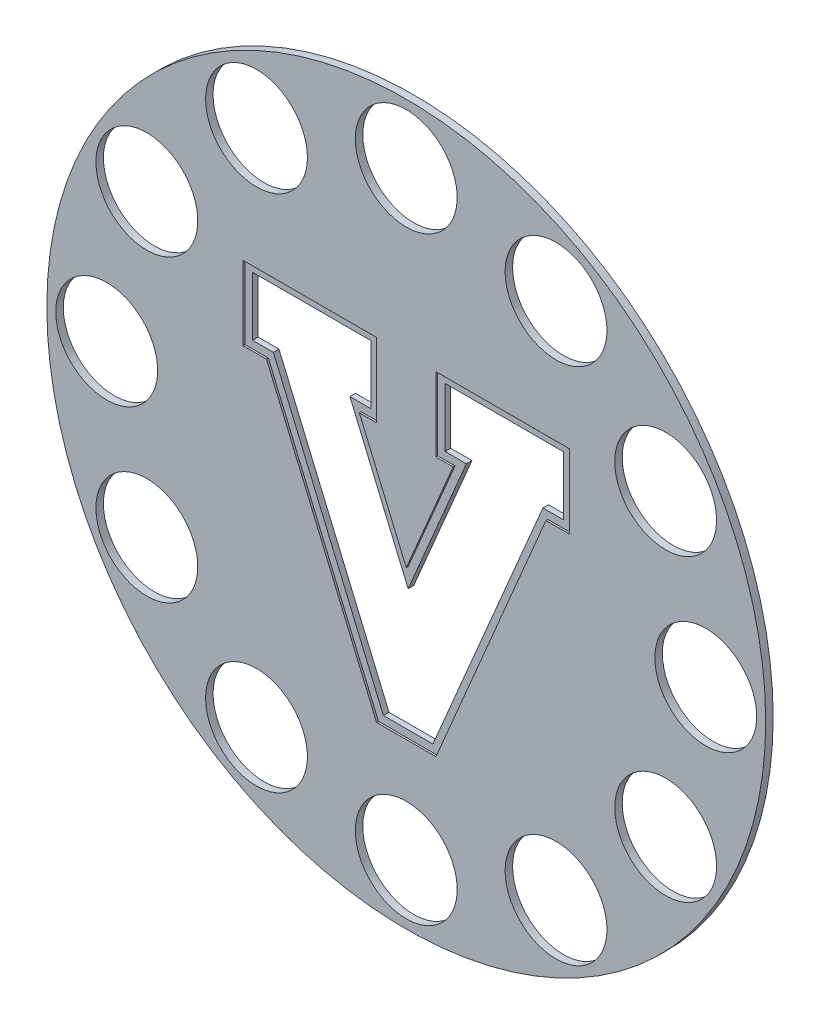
ISO-10303-21;
HEADER;
FILE_DESCRIPTION(('STEP AP214'),'2;1');
FILE_NAME('part.step','',(''),(''),'','','');
FILE_SCHEMA(('AUTOMOTIVE_DESIGN { 1 0 10303 214 1 1 1 1 }'));
ENDSEC;
DATA;
#1=APPLICATION_CONTEXT('core data for automotive mechanical design processes');
#2=APPLICATION_PROTOCOL_DEFINITION('international standard','automotive_design',2000,#1);
#3=PRODUCT_CONTEXT('',#1,'mechanical');
#4=PRODUCT('Part','Part','',(#3));
#5=PRODUCT_RELATED_PRODUCT_CATEGORY('part','',(#4));
#6=PRODUCT_DEFINITION_FORMATION('','',#4);
#7=PRODUCT_DEFINITION_CONTEXT('part definition',#1,'design');
#8=PRODUCT_DEFINITION('design','',#6,#7);
#9=PRODUCT_DEFINITION_SHAPE('','',#8);
#10=(LENGTH_UNIT() NAMED_UNIT(*) SI_UNIT(.MILLI.,.METRE.));
#11=(NAMED_UNIT(*) PLANE_ANGLE_UNIT() SI_UNIT($,.RADIAN.));
#12=(NAMED_UNIT(*) SI_UNIT($,.STERADIAN.) SOLID_ANGLE_UNIT());
#13=UNCERTAINTY_MEASURE_WITH_UNIT(LENGTH_MEASURE(1.E-05),#10,'distance_accuracy_value','');
#14=(GEOMETRIC_REPRESENTATION_CONTEXT(3) GLOBAL_UNCERTAINTY_ASSIGNED_CONTEXT((#13)) GLOBAL_UNIT_ASSIGNED_CONTEXT((#10,
#11,#12)) REPRESENTATION_CONTEXT('',''));
#15=CARTESIAN_POINT('',(0.,0.,0.));
#16=DIRECTION('',(0.,0.,1.));
#17=DIRECTION('',(1.,0.,0.));
#18=AXIS2_PLACEMENT_3D('',#15,#16,#17);
#19=CARTESIAN_POINT('',(0.,0.,12.7));
#20=DIRECTION('',(0.,0.,1.));
#21=DIRECTION('',(1.,0.,0.));
#22=AXIS2_PLACEMENT_3D('',#19,#20,#21);
#23=PLANE('',#22);
#24=CARTESIAN_POINT('',(-253.999999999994,439.940905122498,12.7));
#25=DIRECTION('',(0.,0.,1.));
#26=DIRECTION('',(1.,0.,0.));
#27=AXIS2_PLACEMENT_3D('',#24,#25,#26);
#28=CIRCLE('',#27,86.36);
#29=CARTESIAN_POINT('',(-340.359999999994,439.940905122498,12.7));
#30=VERTEX_POINT('',#29);
#31=EDGE_CURVE('E260',#30,#30,#28,.T.);
#32=ORIENTED_EDGE('',*,*,#31,.F.);
#33=EDGE_LOOP('',(#32));
#34=FACE_BOUND('',#33,.T.);
#35=CARTESIAN_POINT('',(-507.999999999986,-1.44382283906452E-11,12.7));
#36=DIRECTION('',(0.,0.,1.));
#37=DIRECTION('',(1.,0.,0.));
#38=AXIS2_PLACEMENT_3D('',#35,#36,#37);
#39=CIRCLE('',#38,86.3600000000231);
#40=CARTESIAN_POINT('',(-594.360000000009,-1.44382283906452E-11,12.7));
#41=VERTEX_POINT('',#40);
#42=EDGE_CURVE('E272',#41,#41,#39,.T.);
#43=ORIENTED_EDGE('',*,*,#42,.F.);
#44=EDGE_LOOP('',(#43));
#45=FACE_BOUND('',#44,.T.);
#46=CARTESIAN_POINT('',(-253.999999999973,-439.940905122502,12.7));
#47=DIRECTION('',(0.,0.,1.));
#48=DIRECTION('',(1.,0.,0.));
#49=AXIS2_PLACEMENT_3D('',#46,#47,#48);
#50=CIRCLE('',#49,86.360000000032);
#51=CARTESIAN_POINT('',(-340.360000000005,-439.940905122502,12.7));
#52=VERTEX_POINT('',#51);
#53=EDGE_CURVE('E284',#52,#52,#50,.T.);
#54=ORIENTED_EDGE('',*,*,#53,.F.);
#55=EDGE_LOOP('',(#54));
#56=FACE_BOUND('',#55,.T.);
#57=CARTESIAN_POINT('',(254.000000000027,-439.940905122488,12.7));
#58=DIRECTION('',(0.,0.,1.));
#59=DIRECTION('',(1.,0.,0.));
#60=AXIS2_PLACEMENT_3D('',#57,#58,#59);
#61=CIRCLE('',#60,86.3600000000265);
#62=CARTESIAN_POINT('',(167.64,-439.940905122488,12.7));
#63=VERTEX_POINT('',#62);
#64=EDGE_CURVE('E296',#63,#63,#61,.T.);
#65=ORIENTED_EDGE('',*,*,#64,.F.);
#66=EDGE_LOOP('',(#65));
#67=FACE_BOUND('',#66,.T.);
#68=CARTESIAN_POINT('',(508.000000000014,1.43760163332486E-11,12.7));
#69=DIRECTION('',(0.,0.,1.));
#70=DIRECTION('',(1.,0.,0.));
#71=AXIS2_PLACEMENT_3D('',#68,#69,#70);
#72=CIRCLE('',#71,86.3600000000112);
#73=CARTESIAN_POINT('',(421.640000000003,1.43760163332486E-11,12.7));
#74=VERTEX_POINT('',#73);
#75=EDGE_CURVE('E308',#74,#74,#72,.T.);
#76=ORIENTED_EDGE('',*,*,#75,.F.);
#77=EDGE_LOOP('',(#76));
#78=FACE_BOUND('',#77,.T.);
#79=CARTESIAN_POINT('',(254.000000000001,439.940905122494,12.7));
#80=DIRECTION('',(0.,0.,1.));
#81=DIRECTION('',(1.,0.,0.));
#82=AXIS2_PLACEMENT_3D('',#79,#80,#81);
#83=CIRCLE('',#82,86.36);
#84=CARTESIAN_POINT('',(167.64,439.940905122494,12.7));
#85=VERTEX_POINT('',#84);
#86=EDGE_CURVE('E320',#85,#85,#83,.T.);
#87=ORIENTED_EDGE('',*,*,#86,.F.);
#88=EDGE_LOOP('',(#87));
#89=FACE_BOUND('',#88,.T.);
#90=CARTESIAN_POINT('',(0.,0.,12.7));
#91=DIRECTION('',(0.,0.,1.));
#92=DIRECTION('',(1.,0.,0.));
#93=AXIS2_PLACEMENT_3D('',#90,#91,#92);
#94=CIRCLE('',#93,609.6);
#95=CARTESIAN_POINT('',(-609.6,0.,12.7));
#96=VERTEX_POINT('',#95);
#97=EDGE_CURVE('E332',#96,#96,#94,.T.);
#98=ORIENTED_EDGE('',*,*,#97,.T.);
#99=EDGE_LOOP('',(#98));
#100=FACE_BOUND('',#99,.T.);
#101=CARTESIAN_POINT('',(0.,508.,12.7));
#102=DIRECTION('',(0.,0.,1.));
#103=DIRECTION('',(1.,0.,0.));
#104=AXIS2_PLACEMENT_3D('',#101,#102,#103);
#105=CIRCLE('',#104,86.36);
#106=CARTESIAN_POINT('',(-86.36,508.,12.7));
#107=VERTEX_POINT('',#106);
#108=EDGE_CURVE('E326',#107,#107,#105,.T.);
#109=ORIENTED_EDGE('',*,*,#108,.F.);
#110=EDGE_LOOP('',(#109));
#111=FACE_BOUND('',#110,.T.);
#112=CARTESIAN_POINT('',(439.940905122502,254.000000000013,12.7));
#113=DIRECTION('',(0.,0.,1.));
#114=DIRECTION('',(1.,0.,0.));
#115=AXIS2_PLACEMENT_3D('',#112,#113,#114);
#116=CIRCLE('',#115,86.3600000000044);
#117=CARTESIAN_POINT('',(353.580905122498,254.000000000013,12.7));
#118=VERTEX_POINT('',#117);
#119=EDGE_CURVE('E314',#118,#118,#116,.T.);
#120=ORIENTED_EDGE('',*,*,#119,.F.);
#121=EDGE_LOOP('',(#120));
#122=FACE_BOUND('',#121,.T.);
#123=CARTESIAN_POINT('',(439.940905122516,-253.999999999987,12.7));
#124=DIRECTION('',(0.,0.,1.));
#125=DIRECTION('',(1.,0.,0.));
#126=AXIS2_PLACEMENT_3D('',#123,#124,#125);
#127=CIRCLE('',#126,86.3600000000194);
#128=CARTESIAN_POINT('',(353.580905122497,-253.999999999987,12.7));
#129=VERTEX_POINT('',#128);
#130=EDGE_CURVE('E302',#129,#129,#127,.T.);
#131=ORIENTED_EDGE('',*,*,#130,.F.);
#132=EDGE_LOOP('',(#131));
#133=FACE_BOUND('',#132,.T.);
#134=CARTESIAN_POINT('',(2.87520326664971E-11,-508.,12.7));
#135=DIRECTION('',(0.,0.,1.));
#136=DIRECTION('',(1.,0.,0.));
#137=AXIS2_PLACEMENT_3D('',#134,#135,#136);
#138=CIRCLE('',#137,86.3600000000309);
#139=CARTESIAN_POINT('',(-86.3600000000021,-508.,12.7));
#140=VERTEX_POINT('',#139);
#141=EDGE_CURVE('E290',#140,#140,#138,.T.);
#142=ORIENTED_EDGE('',*,*,#141,.F.);
#143=EDGE_LOOP('',(#142));
#144=FACE_BOUND('',#143,.T.);
#145=CARTESIAN_POINT('',(-439.940905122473,-254.000000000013,12.7));
#146=DIRECTION('',(0.,0.,1.));
#147=DIRECTION('',(1.,0.,0.));
#148=AXIS2_PLACEMENT_3D('',#145,#146,#147);
#149=CIRCLE('',#148,86.360000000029);
#150=CARTESIAN_POINT('',(-526.300905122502,-254.000000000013,12.7));
#151=VERTEX_POINT('',#150);
#152=EDGE_CURVE('E278',#151,#151,#149,.T.);
#153=ORIENTED_EDGE('',*,*,#152,.F.);
#154=EDGE_LOOP('',(#153));
#155=FACE_BOUND('',#154,.T.);
#156=CARTESIAN_POINT('',(-439.940905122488,253.999999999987,12.7));
#157=DIRECTION('',(0.,0.,1.));
#158=DIRECTION('',(1.,0.,0.));
#159=AXIS2_PLACEMENT_3D('',#156,#157,#158);
#160=CIRCLE('',#159,86.3600000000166);
#161=CARTESIAN_POINT('',(-526.300905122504,253.999999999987,12.7));
#162=VERTEX_POINT('',#161);
#163=EDGE_CURVE('E266',#162,#162,#160,.T.);
#164=ORIENTED_EDGE('',*,*,#163,.F.);
#165=EDGE_LOOP('',(#164));
#166=FACE_BOUND('',#165,.T.);
#167=DIRECTION('',(0.39031398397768,0.920681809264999,0.));
#168=VECTOR('',#167,1.);
#169=CARTESIAN_POINT('',(28.2674684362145,-11.9837147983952,12.7));
#170=LINE('',#169,#168);
#171=CARTESIAN_POINT('',(0.,-78.6616844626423,12.7));
#172=VERTEX_POINT('',#171);
#173=CARTESIAN_POINT('',(79.6079892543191,109.119513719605,12.7));
#174=VERTEX_POINT('',#173);
#175=EDGE_CURVE('E42',#172,#174,#170,.T.);
#176=ORIENTED_EDGE('',*,*,#175,.T.);
#177=DIRECTION('',(-1.,0.,0.));
#178=VECTOR('',#177,1.);
#179=CARTESIAN_POINT('',(0.,109.119513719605,12.7));
#180=LINE('',#179,#178);
#181=CARTESIAN_POINT('',(50.0582626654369,109.119513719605,12.7));
#182=VERTEX_POINT('',#181);
#183=EDGE_CURVE('E11',#174,#182,#180,.T.);
#184=ORIENTED_EDGE('',*,*,#183,.T.);
#185=DIRECTION('',(0.,1.,0.));
#186=VECTOR('',#185,1.);
#187=CARTESIAN_POINT('',(50.0582626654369,0.,12.7));
#188=LINE('',#187,#186);
#189=CARTESIAN_POINT('',(50.0582626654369,234.46785796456,12.7));
#190=VERTEX_POINT('',#189);
#191=EDGE_CURVE('E335',#182,#190,#188,.T.);
#192=ORIENTED_EDGE('',*,*,#191,.T.);
#193=DIRECTION('',(1.,0.,0.));
#194=VECTOR('',#193,1.);
#195=CARTESIAN_POINT('',(0.,234.46785796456,12.7));
#196=LINE('',#195,#194);
#197=CARTESIAN_POINT('',(276.517141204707,234.46785796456,12.7));
#198=VERTEX_POINT('',#197);
#199=EDGE_CURVE('E340',#190,#198,#196,.T.);
#200=ORIENTED_EDGE('',*,*,#199,.T.);
#201=DIRECTION('',(0.,-1.,0.));
#202=VECTOR('',#201,1.);
#203=CARTESIAN_POINT('',(276.517141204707,0.,12.7));
#204=LINE('',#203,#202);
#205=CARTESIAN_POINT('',(276.517141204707,109.119513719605,12.7));
#206=VERTEX_POINT('',#205);
#207=EDGE_CURVE('E343',#198,#206,#204,.T.);
#208=ORIENTED_EDGE('',*,*,#207,.T.);
#209=DIRECTION('',(-1.,0.,0.));
#210=VECTOR('',#209,1.);
#211=CARTESIAN_POINT('',(0.,109.119513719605,12.7));
#212=LINE('',#211,#210);
#213=CARTESIAN_POINT('',(236.957980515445,109.119513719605,12.7));
#214=VERTEX_POINT('',#213);
#215=EDGE_CURVE('E346',#206,#214,#212,.T.);
#216=ORIENTED_EDGE('',*,*,#215,.T.);
#217=DIRECTION('',(-0.39031398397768,-0.920681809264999,0.));
#218=VECTOR('',#217,1.);
#219=CARTESIAN_POINT('',(161.645974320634,-68.5282185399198,12.7));
#220=LINE('',#219,#218);
#221=CARTESIAN_POINT('',(50.3793641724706,-330.986516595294,12.7));
#222=VERTEX_POINT('',#221);
#223=EDGE_CURVE('E349',#214,#222,#220,.T.);
#224=ORIENTED_EDGE('',*,*,#223,.T.);
#225=DIRECTION('',(-1.,0.,0.));
#226=VECTOR('',#225,1.);
#227=CARTESIAN_POINT('',(0.,-330.986516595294,12.7));
#228=LINE('',#227,#226);
#229=CARTESIAN_POINT('',(-50.3793641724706,-330.986516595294,12.7));
#230=VERTEX_POINT('',#229);
#231=EDGE_CURVE('E352',#222,#230,#228,.T.);
#232=ORIENTED_EDGE('',*,*,#231,.T.);
#233=DIRECTION('',(-0.39031398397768,0.920681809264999,0.));
#234=VECTOR('',#233,1.);
#235=CARTESIAN_POINT('',(-161.645974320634,-68.5282185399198,12.7));
#236=LINE('',#235,#234);
#237=CARTESIAN_POINT('',(-236.957980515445,109.119513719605,12.7));
#238=VERTEX_POINT('',#237);
#239=EDGE_CURVE('E355',#230,#238,#236,.T.);
#240=ORIENTED_EDGE('',*,*,#239,.T.);
#241=DIRECTION('',(-1.,0.,0.));
#242=VECTOR('',#241,1.);
#243=CARTESIAN_POINT('',(0.,109.119513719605,12.7));
#244=LINE('',#243,#242);
#245=CARTESIAN_POINT('',(-276.517141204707,109.119513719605,12.7));
#246=VERTEX_POINT('',#245);
#247=EDGE_CURVE('E358',#238,#246,#244,.T.);
#248=ORIENTED_EDGE('',*,*,#247,.T.);
#249=DIRECTION('',(0.,1.,0.));
#250=VECTOR('',#249,1.);
#251=CARTESIAN_POINT('',(-276.517141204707,0.,12.7));
#252=LINE('',#251,#250);
#253=CARTESIAN_POINT('',(-276.517141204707,234.46785796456,12.7));
#254=VERTEX_POINT('',#253);
#255=EDGE_CURVE('E361',#246,#254,#252,.T.);
#256=ORIENTED_EDGE('',*,*,#255,.T.);
#257=DIRECTION('',(1.,0.,0.));
#258=VECTOR('',#257,1.);
#259=CARTESIAN_POINT('',(0.,234.46785796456,12.7));
#260=LINE('',#259,#258);
#261=CARTESIAN_POINT('',(-50.0582626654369,234.46785796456,12.7));
#262=VERTEX_POINT('',#261);
#263=EDGE_CURVE('E364',#254,#262,#260,.T.);
#264=ORIENTED_EDGE('',*,*,#263,.T.);
#265=DIRECTION('',(0.,-1.,0.));
#266=VECTOR('',#265,1.);
#267=CARTESIAN_POINT('',(-50.0582626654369,0.,12.7));
#268=LINE('',#267,#266);
#269=CARTESIAN_POINT('',(-50.0582626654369,109.119513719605,12.7));
#270=VERTEX_POINT('',#269);
#271=EDGE_CURVE('E367',#262,#270,#268,.T.);
#272=ORIENTED_EDGE('',*,*,#271,.T.);
#273=DIRECTION('',(-1.,0.,0.));
#274=VECTOR('',#273,1.);
#275=CARTESIAN_POINT('',(0.,109.119513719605,12.7));
#276=LINE('',#275,#274);
#277=CARTESIAN_POINT('',(-79.607989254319,109.119513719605,12.7));
#278=VERTEX_POINT('',#277);
#279=EDGE_CURVE('E370',#270,#278,#276,.T.);
#280=ORIENTED_EDGE('',*,*,#279,.T.);
#281=DIRECTION('',(0.39031398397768,-0.920681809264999,0.));
#282=VECTOR('',#281,1.);
#283=CARTESIAN_POINT('',(-28.2674684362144,-11.9837147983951,12.7));
#284=LINE('',#283,#282);
#285=EDGE_CURVE('E373',#278,#172,#284,.T.);
#286=ORIENTED_EDGE('',*,*,#285,.T.);
#287=EDGE_LOOP('',(#176,#184,#192,#200,#208,#216,#224,#232,#240,#248,#256,#264,#272,#280,#286));
#288=FACE_BOUND('',#287,.T.);
#289=ADVANCED_FACE('F34',(#34,#45,#56,#67,#78,#89,#100,#111,#122,#133,#144,#155,#166,#288),#23,.T.);
#290=CARTESIAN_POINT('',(-263.817141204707,121.819513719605,12.7));
#291=DIRECTION('',(1.,0.,0.));
#292=DIRECTION('',(0.,0.,-1.));
#293=AXIS2_PLACEMENT_3D('',#290,#291,#292);
#294=PLANE('',#293);
#295=DIRECTION('',(0.,0.,-1.));
#296=VECTOR('',#295,1.);
#297=CARTESIAN_POINT('',(-263.817141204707,221.76785796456,12.7));
#298=LINE('',#297,#296);
#299=CARTESIAN_POINT('',(-263.817141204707,221.76785796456,9.525));
#300=VERTEX_POINT('',#299);
#301=CARTESIAN_POINT('',(-263.817141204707,221.76785796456,0.));
#302=VERTEX_POINT('',#301);
#303=EDGE_CURVE('E440',#300,#302,#298,.T.);
#304=ORIENTED_EDGE('',*,*,#303,.F.);
#305=DIRECTION('',(0.,1.,0.));
#306=VECTOR('',#305,1.);
#307=CARTESIAN_POINT('',(-263.817141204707,0.,9.525));
#308=LINE('',#307,#306);
#309=CARTESIAN_POINT('',(-263.817141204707,121.819513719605,9.525));
#310=VERTEX_POINT('',#309);
#311=EDGE_CURVE('E57',#310,#300,#308,.T.);
#312=ORIENTED_EDGE('',*,*,#311,.F.);
#313=DIRECTION('',(0.,0.,-1.));
#314=VECTOR('',#313,1.);
#315=CARTESIAN_POINT('',(-263.817141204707,121.819513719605,12.7));
#316=LINE('',#315,#314);
#317=CARTESIAN_POINT('',(-263.817141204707,121.819513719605,0.));
#318=VERTEX_POINT('',#317);
#319=EDGE_CURVE('E246',#310,#318,#316,.T.);
#320=ORIENTED_EDGE('',*,*,#319,.T.);
#321=DIRECTION('',(0.,-1.,0.));
#322=VECTOR('',#321,1.);
#323=CARTESIAN_POINT('',(-263.817141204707,121.819513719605,0.));
#324=LINE('',#323,#322);
#325=EDGE_CURVE('E393',#302,#318,#324,.T.);
#326=ORIENTED_EDGE('',*,*,#325,.F.);
#327=EDGE_LOOP('',(#304,#312,#320,#326));
#328=FACE_BOUND('',#327,.T.);
#329=ADVANCED_FACE('F477',(#328),#294,.T.);
#330=CARTESIAN_POINT('',(-228.547895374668,121.819513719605,12.7));
#331=DIRECTION('',(0.,1.,0.));
#332=DIRECTION('',(0.,0.,1.));
#333=AXIS2_PLACEMENT_3D('',#330,#331,#332);
#334=PLANE('',#333);
#335=ORIENTED_EDGE('',*,*,#319,.F.);
#336=DIRECTION('',(-1.,0.,0.));
#337=VECTOR('',#336,1.);
#338=CARTESIAN_POINT('',(0.,121.819513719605,9.525));
#339=LINE('',#338,#337);
#340=CARTESIAN_POINT('',(-228.547895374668,121.819513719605,9.525));
#341=VERTEX_POINT('',#340);
#342=EDGE_CURVE('E233',#341,#310,#339,.T.);
#343=ORIENTED_EDGE('',*,*,#342,.F.);
#344=DIRECTION('',(0.,0.,-1.));
#345=VECTOR('',#344,1.);
#346=CARTESIAN_POINT('',(-228.547895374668,121.819513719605,12.7));
#347=LINE('',#346,#345);
#348=CARTESIAN_POINT('',(-228.547895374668,121.819513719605,0.));
#349=VERTEX_POINT('',#348);
#350=EDGE_CURVE('E244',#341,#349,#347,.T.);
#351=ORIENTED_EDGE('',*,*,#350,.T.);
#352=DIRECTION('',(1.,0.,0.));
#353=VECTOR('',#352,1.);
#354=CARTESIAN_POINT('',(-228.547895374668,121.819513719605,0.));
#355=LINE('',#354,#353);
#356=EDGE_CURVE('E401',#318,#349,#355,.T.);
#357=ORIENTED_EDGE('',*,*,#356,.F.);
#358=EDGE_LOOP('',(#335,#343,#351,#357));
#359=FACE_BOUND('',#358,.T.);
#360=ADVANCED_FACE('F242',(#359),#334,.T.);
#361=CARTESIAN_POINT('',(-41.9692790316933,-318.286516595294,12.7));
#362=DIRECTION('',(0.920681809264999,0.39031398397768,0.));
#363=DIRECTION('',(-0.39031398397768,0.920681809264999,0.));
#364=AXIS2_PLACEMENT_3D('',#361,#362,#363);
#365=PLANE('',#364);
#366=ORIENTED_EDGE('',*,*,#350,.F.);
#367=DIRECTION('',(-0.39031398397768,0.920681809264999,0.));
#368=VECTOR('',#367,1.);
#369=CARTESIAN_POINT('',(-149.953315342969,-63.5712309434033,9.525));
#370=LINE('',#369,#368);
#371=CARTESIAN_POINT('',(-41.9692790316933,-318.286516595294,9.525));
#372=VERTEX_POINT('',#371);
#373=EDGE_CURVE('E229',#372,#341,#370,.T.);
#374=ORIENTED_EDGE('',*,*,#373,.F.);
#375=DIRECTION('',(0.,0.,-1.));
#376=VECTOR('',#375,1.);
#377=CARTESIAN_POINT('',(-41.9692790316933,-318.286516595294,12.7));
#378=LINE('',#377,#376);
#379=CARTESIAN_POINT('',(-41.9692790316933,-318.286516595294,0.));
#380=VERTEX_POINT('',#379);
#381=EDGE_CURVE('E252',#372,#380,#378,.T.);
#382=ORIENTED_EDGE('',*,*,#381,.T.);
#383=DIRECTION('',(0.39031398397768,-0.920681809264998,0.));
#384=VECTOR('',#383,1.);
#385=CARTESIAN_POINT('',(-41.9692790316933,-318.286516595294,0.));
#386=LINE('',#385,#384);
#387=EDGE_CURVE('E250',#349,#380,#386,.T.);
#388=ORIENTED_EDGE('',*,*,#387,.F.);
#389=EDGE_LOOP('',(#366,#374,#382,#388));
#390=FACE_BOUND('',#389,.T.);
#391=ADVANCED_FACE('F248',(#390),#365,.T.);
#392=CARTESIAN_POINT('',(41.9692790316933,-318.286516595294,12.7));
#393=DIRECTION('',(0.,1.,0.));
#394=DIRECTION('',(0.,0.,1.));
#395=AXIS2_PLACEMENT_3D('',#392,#393,#394);
#396=PLANE('',#395);
#397=ORIENTED_EDGE('',*,*,#381,.F.);
#398=DIRECTION('',(-1.,0.,0.));
#399=VECTOR('',#398,1.);
#400=CARTESIAN_POINT('',(0.,-318.286516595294,9.525));
#401=LINE('',#400,#399);
#402=CARTESIAN_POINT('',(41.9692790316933,-318.286516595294,9.525));
#403=VERTEX_POINT('',#402);
#404=EDGE_CURVE('E235',#403,#372,#401,.T.);
#405=ORIENTED_EDGE('',*,*,#404,.F.);
#406=DIRECTION('',(0.,0.,-1.));
#407=VECTOR('',#406,1.);
#408=CARTESIAN_POINT('',(41.9692790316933,-318.286516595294,12.7));
#409=LINE('',#408,#407);
#410=CARTESIAN_POINT('',(41.9692790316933,-318.286516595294,0.));
#411=VERTEX_POINT('',#410);
#412=EDGE_CURVE('E256',#403,#411,#409,.T.);
#413=ORIENTED_EDGE('',*,*,#412,.T.);
#414=DIRECTION('',(1.,0.,0.));
#415=VECTOR('',#414,1.);
#416=CARTESIAN_POINT('',(41.9692790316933,-318.286516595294,0.));
#417=LINE('',#416,#415);
#418=EDGE_CURVE('E404',#380,#411,#417,.T.);
#419=ORIENTED_EDGE('',*,*,#418,.F.);
#420=EDGE_LOOP('',(#397,#405,#413,#419));
#421=FACE_BOUND('',#420,.T.);
#422=ADVANCED_FACE('F465',(#421),#396,.T.);
#423=CARTESIAN_POINT('',(41.9692790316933,-318.286516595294,12.7));
#424=DIRECTION('',(-0.920681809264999,0.39031398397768,0.));
#425=DIRECTION('',(-0.39031398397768,-0.920681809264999,0.));
#426=AXIS2_PLACEMENT_3D('',#423,#424,#425);
#427=PLANE('',#426);
#428=ORIENTED_EDGE('',*,*,#412,.F.);
#429=DIRECTION('',(-0.39031398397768,-0.920681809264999,0.));
#430=VECTOR('',#429,1.);
#431=CARTESIAN_POINT('',(149.953315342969,-63.5712309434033,9.525));
#432=LINE('',#431,#430);
#433=CARTESIAN_POINT('',(228.547895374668,121.819513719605,9.525));
#434=VERTEX_POINT('',#433);
#435=EDGE_CURVE('E500',#434,#403,#432,.T.);
#436=ORIENTED_EDGE('',*,*,#435,.F.);
#437=DIRECTION('',(0.,0.,-1.));
#438=VECTOR('',#437,1.);
#439=CARTESIAN_POINT('',(228.547895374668,121.819513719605,12.7));
#440=LINE('',#439,#438);
#441=CARTESIAN_POINT('',(228.547895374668,121.819513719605,0.));
#442=VERTEX_POINT('',#441);
#443=EDGE_CURVE('E460',#434,#442,#440,.T.);
#444=ORIENTED_EDGE('',*,*,#443,.T.);
#445=DIRECTION('',(0.39031398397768,0.920681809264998,0.));
#446=VECTOR('',#445,1.);
#447=CARTESIAN_POINT('',(41.9692790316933,-318.286516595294,0.));
#448=LINE('',#447,#446);
#449=EDGE_CURVE('E407',#411,#442,#448,.T.);
#450=ORIENTED_EDGE('',*,*,#449,.F.);
#451=EDGE_LOOP('',(#428,#436,#444,#450));
#452=FACE_BOUND('',#451,.T.);
#453=ADVANCED_FACE('F468',(#452),#427,.T.);
#454=CARTESIAN_POINT('',(228.547895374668,121.819513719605,12.7));
#455=DIRECTION('',(0.,1.,0.));
#456=DIRECTION('',(0.,0.,1.));
#457=AXIS2_PLACEMENT_3D('',#454,#455,#456);
#458=PLANE('',#457);
#459=ORIENTED_EDGE('',*,*,#443,.F.);
#460=DIRECTION('',(-1.,0.,0.));
#461=VECTOR('',#460,1.);
#462=CARTESIAN_POINT('',(0.,121.819513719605,9.525));
#463=LINE('',#462,#461);
#464=CARTESIAN_POINT('',(263.817141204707,121.819513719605,9.525));
#465=VERTEX_POINT('',#464);
#466=EDGE_CURVE('E498',#465,#434,#463,.T.);
#467=ORIENTED_EDGE('',*,*,#466,.F.);
#468=DIRECTION('',(0.,0.,-1.));
#469=VECTOR('',#468,1.);
#470=CARTESIAN_POINT('',(263.817141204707,121.819513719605,12.7));
#471=LINE('',#470,#469);
#472=CARTESIAN_POINT('',(263.817141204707,121.819513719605,0.));
#473=VERTEX_POINT('',#472);
#474=EDGE_CURVE('E458',#465,#473,#471,.T.);
#475=ORIENTED_EDGE('',*,*,#474,.T.);
#476=DIRECTION('',(1.,0.,0.));
#477=VECTOR('',#476,1.);
#478=CARTESIAN_POINT('',(228.547895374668,121.819513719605,0.));
#479=LINE('',#478,#477);
#480=EDGE_CURVE('E410',#442,#473,#479,.T.);
#481=ORIENTED_EDGE('',*,*,#480,.F.);
#482=EDGE_LOOP('',(#459,#467,#475,#481));
#483=FACE_BOUND('',#482,.T.);
#484=ADVANCED_FACE('F822',(#483),#458,.T.);
#485=CARTESIAN_POINT('',(263.817141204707,121.819513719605,12.7));
#486=DIRECTION('',(-1.,0.,0.));
#487=DIRECTION('',(0.,0.,1.));
#488=AXIS2_PLACEMENT_3D('',#485,#486,#487);
#489=PLANE('',#488);
#490=ORIENTED_EDGE('',*,*,#474,.F.);
#491=DIRECTION('',(0.,-1.,0.));
#492=VECTOR('',#491,1.);
#493=CARTESIAN_POINT('',(263.817141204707,0.,9.525));
#494=LINE('',#493,#492);
#495=CARTESIAN_POINT('',(263.817141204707,221.76785796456,9.525));
#496=VERTEX_POINT('',#495);
#497=EDGE_CURVE('E496',#496,#465,#494,.T.);
#498=ORIENTED_EDGE('',*,*,#497,.F.);
#499=DIRECTION('',(0.,0.,-1.));
#500=VECTOR('',#499,1.);
#501=CARTESIAN_POINT('',(263.817141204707,221.76785796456,12.7));
#502=LINE('',#501,#500);
#503=CARTESIAN_POINT('',(263.817141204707,221.76785796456,0.));
#504=VERTEX_POINT('',#503);
#505=EDGE_CURVE('E456',#496,#504,#502,.T.);
#506=ORIENTED_EDGE('',*,*,#505,.T.);
#507=DIRECTION('',(0.,1.,0.));
#508=VECTOR('',#507,1.);
#509=CARTESIAN_POINT('',(263.817141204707,121.819513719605,0.));
#510=LINE('',#509,#508);
#511=EDGE_CURVE('E413',#473,#504,#510,.T.);
#512=ORIENTED_EDGE('',*,*,#511,.F.);
#513=EDGE_LOOP('',(#490,#498,#506,#512));
#514=FACE_BOUND('',#513,.T.);
#515=ADVANCED_FACE('F831',(#514),#489,.T.);
#516=CARTESIAN_POINT('',(263.817141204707,221.76785796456,12.7));
#517=DIRECTION('',(0.,-1.,0.));
#518=DIRECTION('',(0.,0.,-1.));
#519=AXIS2_PLACEMENT_3D('',#516,#517,#518);
#520=PLANE('',#519);
#521=ORIENTED_EDGE('',*,*,#505,.F.);
#522=DIRECTION('',(1.,0.,0.));
#523=VECTOR('',#522,1.);
#524=CARTESIAN_POINT('',(0.,221.76785796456,9.525));
#525=LINE('',#524,#523);
#526=CARTESIAN_POINT('',(62.758262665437,221.76785796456,9.525));
#527=VERTEX_POINT('',#526);
#528=EDGE_CURVE('E494',#527,#496,#525,.T.);
#529=ORIENTED_EDGE('',*,*,#528,.F.);
#530=DIRECTION('',(0.,0.,-1.));
#531=VECTOR('',#530,1.);
#532=CARTESIAN_POINT('',(62.7582626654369,221.76785796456,12.7));
#533=LINE('',#532,#531);
#534=CARTESIAN_POINT('',(62.7582626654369,221.76785796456,0.));
#535=VERTEX_POINT('',#534);
#536=EDGE_CURVE('E454',#527,#535,#533,.T.);
#537=ORIENTED_EDGE('',*,*,#536,.T.);
#538=DIRECTION('',(-1.,0.,0.));
#539=VECTOR('',#538,1.);
#540=CARTESIAN_POINT('',(263.817141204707,221.76785796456,0.));
#541=LINE('',#540,#539);
#542=EDGE_CURVE('E416',#504,#535,#541,.T.);
#543=ORIENTED_EDGE('',*,*,#542,.F.);
#544=EDGE_LOOP('',(#521,#529,#537,#543));
#545=FACE_BOUND('',#544,.T.);
#546=ADVANCED_FACE('F841',(#545),#520,.T.);
#547=CARTESIAN_POINT('',(62.7582626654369,221.76785796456,12.7));
#548=DIRECTION('',(1.,0.,0.));
#549=DIRECTION('',(0.,1.,0.));
#550=AXIS2_PLACEMENT_3D('',#547,#548,#549);
#551=PLANE('',#550);
#552=ORIENTED_EDGE('',*,*,#536,.F.);
#553=DIRECTION('',(0.,1.,0.));
#554=VECTOR('',#553,1.);
#555=CARTESIAN_POINT('',(62.7582626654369,0.,9.525));
#556=LINE('',#555,#554);
#557=CARTESIAN_POINT('',(62.7582626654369,121.819513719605,9.525));
#558=VERTEX_POINT('',#557);
#559=EDGE_CURVE('E492',#558,#527,#556,.T.);
#560=ORIENTED_EDGE('',*,*,#559,.F.);
#561=DIRECTION('',(0.,0.,-1.));
#562=VECTOR('',#561,1.);
#563=CARTESIAN_POINT('',(62.7582626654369,121.819513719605,12.7));
#564=LINE('',#563,#562);
#565=CARTESIAN_POINT('',(62.7582626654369,121.819513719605,0.));
#566=VERTEX_POINT('',#565);
#567=EDGE_CURVE('E452',#558,#566,#564,.T.);
#568=ORIENTED_EDGE('',*,*,#567,.T.);
#569=DIRECTION('',(0.,-1.,0.));
#570=VECTOR('',#569,1.);
#571=CARTESIAN_POINT('',(62.7582626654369,221.76785796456,0.));
#572=LINE('',#571,#570);
#573=EDGE_CURVE('E419',#535,#566,#572,.T.);
#574=ORIENTED_EDGE('',*,*,#573,.F.);
#575=EDGE_LOOP('',(#552,#560,#568,#574));
#576=FACE_BOUND('',#575,.T.);
#577=ADVANCED_FACE('F851',(#576),#551,.T.);
#578=CARTESIAN_POINT('',(62.7582626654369,121.819513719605,12.7));
#579=DIRECTION('',(0.,1.,0.));
#580=DIRECTION('',(0.,0.,1.));
#581=AXIS2_PLACEMENT_3D('',#578,#579,#580);
#582=PLANE('',#581);
#583=ORIENTED_EDGE('',*,*,#567,.F.);
#584=DIRECTION('',(-1.,0.,0.));
#585=VECTOR('',#584,1.);
#586=CARTESIAN_POINT('',(0.,121.819513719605,9.525));
#587=LINE('',#586,#585);
#588=CARTESIAN_POINT('',(98.7861541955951,121.819513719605,9.525));
#589=VERTEX_POINT('',#588);
#590=EDGE_CURVE('E490',#589,#558,#587,.T.);
#591=ORIENTED_EDGE('',*,*,#590,.F.);
#592=DIRECTION('',(0.,0.,-1.));
#593=VECTOR('',#592,1.);
#594=CARTESIAN_POINT('',(98.7861541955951,121.819513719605,12.7));
#595=LINE('',#594,#593);
#596=CARTESIAN_POINT('',(98.7861541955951,121.819513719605,0.));
#597=VERTEX_POINT('',#596);
#598=EDGE_CURVE('E450',#589,#597,#595,.T.);
#599=ORIENTED_EDGE('',*,*,#598,.T.);
#600=DIRECTION('',(1.,0.,0.));
#601=VECTOR('',#600,1.);
#602=CARTESIAN_POINT('',(62.7582626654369,121.819513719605,0.));
#603=LINE('',#602,#601);
#604=EDGE_CURVE('E422',#566,#597,#603,.T.);
#605=ORIENTED_EDGE('',*,*,#604,.F.);
#606=EDGE_LOOP('',(#583,#591,#599,#605));
#607=FACE_BOUND('',#606,.T.);
#608=ADVANCED_FACE('F861',(#607),#582,.T.);
#609=CARTESIAN_POINT('',(98.7861541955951,121.819513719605,12.7));
#610=DIRECTION('',(0.920681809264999,-0.39031398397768,0.));
#611=DIRECTION('',(0.39031398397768,0.920681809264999,0.));
#612=AXIS2_PLACEMENT_3D('',#609,#610,#611);
#613=PLANE('',#612);
#614=ORIENTED_EDGE('',*,*,#598,.F.);
#615=DIRECTION('',(0.39031398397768,0.920681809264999,0.));
#616=VECTOR('',#615,1.);
#617=CARTESIAN_POINT('',(39.96012741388,-16.9407023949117,9.525));
#618=LINE('',#617,#616);
#619=CARTESIAN_POINT('',(0.,-111.199591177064,9.525));
#620=VERTEX_POINT('',#619);
#621=EDGE_CURVE('E488',#620,#589,#618,.T.);
#622=ORIENTED_EDGE('',*,*,#621,.F.);
#623=DIRECTION('',(0.,0.,-1.));
#624=VECTOR('',#623,1.);
#625=CARTESIAN_POINT('',(0.,-111.199591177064,12.7));
#626=LINE('',#625,#624);
#627=CARTESIAN_POINT('',(0.,-111.199591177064,0.));
#628=VERTEX_POINT('',#627);
#629=EDGE_CURVE('E448',#620,#628,#626,.T.);
#630=ORIENTED_EDGE('',*,*,#629,.T.);
#631=DIRECTION('',(-0.39031398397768,-0.920681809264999,0.));
#632=VECTOR('',#631,1.);
#633=CARTESIAN_POINT('',(98.7861541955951,121.819513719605,0.));
#634=LINE('',#633,#632);
#635=EDGE_CURVE('E425',#597,#628,#634,.T.);
#636=ORIENTED_EDGE('',*,*,#635,.F.);
#637=EDGE_LOOP('',(#614,#622,#630,#636));
#638=FACE_BOUND('',#637,.T.);
#639=ADVANCED_FACE('F871',(#638),#613,.T.);
#640=CARTESIAN_POINT('',(-98.7861541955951,121.819513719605,12.7));
#641=DIRECTION('',(-0.920681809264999,-0.39031398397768,0.));
#642=DIRECTION('',(0.39031398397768,-0.920681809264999,0.));
#643=AXIS2_PLACEMENT_3D('',#640,#641,#642);
#644=PLANE('',#643);
#645=ORIENTED_EDGE('',*,*,#629,.F.);
#646=DIRECTION('',(0.39031398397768,-0.920681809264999,0.));
#647=VECTOR('',#646,1.);
#648=CARTESIAN_POINT('',(-39.9601274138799,-16.9407023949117,9.525));
#649=LINE('',#648,#647);
#650=CARTESIAN_POINT('',(-98.7861541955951,121.819513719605,9.525));
#651=VERTEX_POINT('',#650);
#652=EDGE_CURVE('E486',#651,#620,#649,.T.);
#653=ORIENTED_EDGE('',*,*,#652,.F.);
#654=DIRECTION('',(0.,0.,-1.));
#655=VECTOR('',#654,1.);
#656=CARTESIAN_POINT('',(-98.7861541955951,121.819513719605,12.7));
#657=LINE('',#656,#655);
#658=CARTESIAN_POINT('',(-98.7861541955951,121.819513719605,0.));
#659=VERTEX_POINT('',#658);
#660=EDGE_CURVE('E446',#651,#659,#657,.T.);
#661=ORIENTED_EDGE('',*,*,#660,.T.);
#662=DIRECTION('',(-0.39031398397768,0.920681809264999,0.));
#663=VECTOR('',#662,1.);
#664=CARTESIAN_POINT('',(-98.7861541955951,121.819513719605,0.));
#665=LINE('',#664,#663);
#666=EDGE_CURVE('E428',#628,#659,#665,.T.);
#667=ORIENTED_EDGE('',*,*,#666,.F.);
#668=EDGE_LOOP('',(#645,#653,#661,#667));
#669=FACE_BOUND('',#668,.T.);
#670=ADVANCED_FACE('F881',(#669),#644,.T.);
#671=CARTESIAN_POINT('',(-62.7582626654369,121.819513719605,12.7));
#672=DIRECTION('',(0.,1.,0.));
#673=DIRECTION('',(0.,0.,1.));
#674=AXIS2_PLACEMENT_3D('',#671,#672,#673);
#675=PLANE('',#674);
#676=ORIENTED_EDGE('',*,*,#660,.F.);
#677=DIRECTION('',(-1.,0.,0.));
#678=VECTOR('',#677,1.);
#679=CARTESIAN_POINT('',(0.,121.819513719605,9.525));
#680=LINE('',#679,#678);
#681=CARTESIAN_POINT('',(-62.7582626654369,121.819513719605,9.525));
#682=VERTEX_POINT('',#681);
#683=EDGE_CURVE('E484',#682,#651,#680,.T.);
#684=ORIENTED_EDGE('',*,*,#683,.F.);
#685=DIRECTION('',(0.,0.,-1.));
#686=VECTOR('',#685,1.);
#687=CARTESIAN_POINT('',(-62.7582626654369,121.819513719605,12.7));
#688=LINE('',#687,#686);
#689=CARTESIAN_POINT('',(-62.7582626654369,121.819513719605,0.));
#690=VERTEX_POINT('',#689);
#691=EDGE_CURVE('E444',#682,#690,#688,.T.);
#692=ORIENTED_EDGE('',*,*,#691,.T.);
#693=DIRECTION('',(1.,0.,0.));
#694=VECTOR('',#693,1.);
#695=CARTESIAN_POINT('',(-62.7582626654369,121.819513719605,0.));
#696=LINE('',#695,#694);
#697=EDGE_CURVE('E431',#659,#690,#696,.T.);
#698=ORIENTED_EDGE('',*,*,#697,.F.);
#699=EDGE_LOOP('',(#676,#684,#692,#698));
#700=FACE_BOUND('',#699,.T.);
#701=ADVANCED_FACE('F891',(#700),#675,.T.);
#702=CARTESIAN_POINT('',(-62.7582626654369,221.76785796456,12.7));
#703=DIRECTION('',(-1.,0.,0.));
#704=DIRECTION('',(0.,-1.,0.));
#705=AXIS2_PLACEMENT_3D('',#702,#703,#704);
#706=PLANE('',#705);
#707=ORIENTED_EDGE('',*,*,#691,.F.);
#708=DIRECTION('',(0.,-1.,0.));
#709=VECTOR('',#708,1.);
#710=CARTESIAN_POINT('',(-62.7582626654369,0.,9.525));
#711=LINE('',#710,#709);
#712=CARTESIAN_POINT('',(-62.7582626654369,221.76785796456,9.525));
#713=VERTEX_POINT('',#712);
#714=EDGE_CURVE('E480',#713,#682,#711,.T.);
#715=ORIENTED_EDGE('',*,*,#714,.F.);
#716=DIRECTION('',(0.,0.,-1.));
#717=VECTOR('',#716,1.);
#718=CARTESIAN_POINT('',(-62.7582626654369,221.76785796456,12.7));
#719=LINE('',#718,#717);
#720=CARTESIAN_POINT('',(-62.7582626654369,221.76785796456,0.));
#721=VERTEX_POINT('',#720);
#722=EDGE_CURVE('E442',#713,#721,#719,.T.);
#723=ORIENTED_EDGE('',*,*,#722,.T.);
#724=DIRECTION('',(0.,1.,0.));
#725=VECTOR('',#724,1.);
#726=CARTESIAN_POINT('',(-62.7582626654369,221.76785796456,0.));
#727=LINE('',#726,#725);
#728=EDGE_CURVE('E434',#690,#721,#727,.T.);
#729=ORIENTED_EDGE('',*,*,#728,.F.);
#730=EDGE_LOOP('',(#707,#715,#723,#729));
#731=FACE_BOUND('',#730,.T.);
#732=ADVANCED_FACE('F641',(#731),#706,.T.);
#733=CARTESIAN_POINT('',(-263.817141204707,221.76785796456,12.7));
#734=DIRECTION('',(0.,-1.,0.));
#735=DIRECTION('',(0.,0.,-1.));
#736=AXIS2_PLACEMENT_3D('',#733,#734,#735);
#737=PLANE('',#736);
#738=ORIENTED_EDGE('',*,*,#722,.F.);
#739=DIRECTION('',(1.,0.,0.));
#740=VECTOR('',#739,1.);
#741=CARTESIAN_POINT('',(0.,221.76785796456,9.525));
#742=LINE('',#741,#740);
#743=EDGE_CURVE('E478',#300,#713,#742,.T.);
#744=ORIENTED_EDGE('',*,*,#743,.F.);
#745=ORIENTED_EDGE('',*,*,#303,.T.);
#746=DIRECTION('',(-1.,0.,0.));
#747=VECTOR('',#746,1.);
#748=CARTESIAN_POINT('',(-263.817141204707,221.76785796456,0.));
#749=LINE('',#748,#747);
#750=EDGE_CURVE('E437',#721,#302,#749,.T.);
#751=ORIENTED_EDGE('',*,*,#750,.F.);
#752=EDGE_LOOP('',(#738,#744,#745,#751));
#753=FACE_BOUND('',#752,.T.);
#754=ADVANCED_FACE('F634',(#753),#737,.T.);
#755=CARTESIAN_POINT('',(0.,0.,0.));
#756=DIRECTION('',(0.,0.,1.));
#757=DIRECTION('',(1.,0.,0.));
#758=AXIS2_PLACEMENT_3D('',#755,#756,#757);
#759=PLANE('',#758);
#760=CARTESIAN_POINT('',(-253.999999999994,439.940905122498,0.));
#761=DIRECTION('',(0.,0.,1.));
#762=DIRECTION('',(1.,0.,0.));
#763=AXIS2_PLACEMENT_3D('',#760,#761,#762);
#764=CIRCLE('',#763,86.36);
#765=CARTESIAN_POINT('',(-340.359999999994,439.940905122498,0.));
#766=VERTEX_POINT('',#765);
#767=EDGE_CURVE('E254',#766,#766,#764,.T.);
#768=ORIENTED_EDGE('',*,*,#767,.T.);
#769=EDGE_LOOP('',(#768));
#770=FACE_BOUND('',#769,.T.);
#771=CARTESIAN_POINT('',(-439.940905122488,253.999999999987,0.));
#772=DIRECTION('',(0.,0.,1.));
#773=DIRECTION('',(1.,0.,0.));
#774=AXIS2_PLACEMENT_3D('',#771,#772,#773);
#775=CIRCLE('',#774,86.3600000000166);
#776=CARTESIAN_POINT('',(-526.300905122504,253.999999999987,0.));
#777=VERTEX_POINT('',#776);
#778=EDGE_CURVE('E263',#777,#777,#775,.T.);
#779=ORIENTED_EDGE('',*,*,#778,.T.);
#780=EDGE_LOOP('',(#779));
#781=FACE_BOUND('',#780,.T.);
#782=CARTESIAN_POINT('',(-507.999999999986,-1.44382283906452E-11,0.));
#783=DIRECTION('',(0.,0.,1.));
#784=DIRECTION('',(1.,0.,0.));
#785=AXIS2_PLACEMENT_3D('',#782,#783,#784);
#786=CIRCLE('',#785,86.3600000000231);
#787=CARTESIAN_POINT('',(-594.360000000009,-1.44382283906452E-11,0.));
#788=VERTEX_POINT('',#787);
#789=EDGE_CURVE('E269',#788,#788,#786,.T.);
#790=ORIENTED_EDGE('',*,*,#789,.T.);
#791=EDGE_LOOP('',(#790));
#792=FACE_BOUND('',#791,.T.);
#793=CARTESIAN_POINT('',(-439.940905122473,-254.000000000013,0.));
#794=DIRECTION('',(0.,0.,1.));
#795=DIRECTION('',(1.,0.,0.));
#796=AXIS2_PLACEMENT_3D('',#793,#794,#795);
#797=CIRCLE('',#796,86.360000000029);
#798=CARTESIAN_POINT('',(-526.300905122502,-254.000000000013,0.));
#799=VERTEX_POINT('',#798);
#800=EDGE_CURVE('E275',#799,#799,#797,.T.);
#801=ORIENTED_EDGE('',*,*,#800,.T.);
#802=EDGE_LOOP('',(#801));
#803=FACE_BOUND('',#802,.T.);
#804=CARTESIAN_POINT('',(-253.999999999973,-439.940905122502,0.));
#805=DIRECTION('',(0.,0.,1.));
#806=DIRECTION('',(1.,0.,0.));
#807=AXIS2_PLACEMENT_3D('',#804,#805,#806);
#808=CIRCLE('',#807,86.360000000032);
#809=CARTESIAN_POINT('',(-340.360000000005,-439.940905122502,0.));
#810=VERTEX_POINT('',#809);
#811=EDGE_CURVE('E281',#810,#810,#808,.T.);
#812=ORIENTED_EDGE('',*,*,#811,.T.);
#813=EDGE_LOOP('',(#812));
#814=FACE_BOUND('',#813,.T.);
#815=CARTESIAN_POINT('',(2.87520326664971E-11,-508.,0.));
#816=DIRECTION('',(0.,0.,1.));
#817=DIRECTION('',(1.,0.,0.));
#818=AXIS2_PLACEMENT_3D('',#815,#816,#817);
#819=CIRCLE('',#818,86.3600000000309);
#820=CARTESIAN_POINT('',(-86.3600000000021,-508.,0.));
#821=VERTEX_POINT('',#820);
#822=EDGE_CURVE('E287',#821,#821,#819,.T.);
#823=ORIENTED_EDGE('',*,*,#822,.T.);
#824=EDGE_LOOP('',(#823));
#825=FACE_BOUND('',#824,.T.);
#826=CARTESIAN_POINT('',(254.000000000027,-439.940905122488,0.));
#827=DIRECTION('',(0.,0.,1.));
#828=DIRECTION('',(1.,0.,0.));
#829=AXIS2_PLACEMENT_3D('',#826,#827,#828);
#830=CIRCLE('',#829,86.3600000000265);
#831=CARTESIAN_POINT('',(167.64,-439.940905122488,0.));
#832=VERTEX_POINT('',#831);
#833=EDGE_CURVE('E293',#832,#832,#830,.T.);
#834=ORIENTED_EDGE('',*,*,#833,.T.);
#835=EDGE_LOOP('',(#834));
#836=FACE_BOUND('',#835,.T.);
#837=CARTESIAN_POINT('',(439.940905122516,-253.999999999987,0.));
#838=DIRECTION('',(0.,0.,1.));
#839=DIRECTION('',(1.,0.,0.));
#840=AXIS2_PLACEMENT_3D('',#837,#838,#839);
#841=CIRCLE('',#840,86.3600000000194);
#842=CARTESIAN_POINT('',(353.580905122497,-253.999999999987,0.));
#843=VERTEX_POINT('',#842);
#844=EDGE_CURVE('E299',#843,#843,#841,.T.);
#845=ORIENTED_EDGE('',*,*,#844,.T.);
#846=EDGE_LOOP('',(#845));
#847=FACE_BOUND('',#846,.T.);
#848=CARTESIAN_POINT('',(508.000000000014,1.43760163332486E-11,0.));
#849=DIRECTION('',(0.,0.,1.));
#850=DIRECTION('',(1.,0.,0.));
#851=AXIS2_PLACEMENT_3D('',#848,#849,#850);
#852=CIRCLE('',#851,86.3600000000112);
#853=CARTESIAN_POINT('',(421.640000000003,1.43760163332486E-11,0.));
#854=VERTEX_POINT('',#853);
#855=EDGE_CURVE('E305',#854,#854,#852,.T.);
#856=ORIENTED_EDGE('',*,*,#855,.T.);
#857=EDGE_LOOP('',(#856));
#858=FACE_BOUND('',#857,.T.);
#859=CARTESIAN_POINT('',(439.940905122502,254.000000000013,0.));
#860=DIRECTION('',(0.,0.,1.));
#861=DIRECTION('',(1.,0.,0.));
#862=AXIS2_PLACEMENT_3D('',#859,#860,#861);
#863=CIRCLE('',#862,86.3600000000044);
#864=CARTESIAN_POINT('',(353.580905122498,254.000000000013,0.));
#865=VERTEX_POINT('',#864);
#866=EDGE_CURVE('E311',#865,#865,#863,.T.);
#867=ORIENTED_EDGE('',*,*,#866,.T.);
#868=EDGE_LOOP('',(#867));
#869=FACE_BOUND('',#868,.T.);
#870=CARTESIAN_POINT('',(254.000000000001,439.940905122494,0.));
#871=DIRECTION('',(0.,0.,1.));
#872=DIRECTION('',(1.,0.,0.));
#873=AXIS2_PLACEMENT_3D('',#870,#871,#872);
#874=CIRCLE('',#873,86.36);
#875=CARTESIAN_POINT('',(167.64,439.940905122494,0.));
#876=VERTEX_POINT('',#875);
#877=EDGE_CURVE('E317',#876,#876,#874,.T.);
#878=ORIENTED_EDGE('',*,*,#877,.T.);
#879=EDGE_LOOP('',(#878));
#880=FACE_BOUND('',#879,.T.);
#881=CARTESIAN_POINT('',(0.,508.,0.));
#882=DIRECTION('',(0.,0.,1.));
#883=DIRECTION('',(1.,0.,0.));
#884=AXIS2_PLACEMENT_3D('',#881,#882,#883);
#885=CIRCLE('',#884,86.36);
#886=CARTESIAN_POINT('',(-86.36,508.,0.));
#887=VERTEX_POINT('',#886);
#888=EDGE_CURVE('E323',#887,#887,#885,.T.);
#889=ORIENTED_EDGE('',*,*,#888,.T.);
#890=EDGE_LOOP('',(#889));
#891=FACE_BOUND('',#890,.T.);
#892=CARTESIAN_POINT('',(0.,0.,0.));
#893=DIRECTION('',(0.,0.,1.));
#894=DIRECTION('',(1.,0.,0.));
#895=AXIS2_PLACEMENT_3D('',#892,#893,#894);
#896=CIRCLE('',#895,609.6);
#897=CARTESIAN_POINT('',(-609.6,0.,0.));
#898=VERTEX_POINT('',#897);
#899=EDGE_CURVE('E329',#898,#898,#896,.T.);
#900=ORIENTED_EDGE('',*,*,#899,.F.);
#901=EDGE_LOOP('',(#900));
#902=FACE_BOUND('',#901,.T.);
#903=ORIENTED_EDGE('',*,*,#325,.T.);
#904=ORIENTED_EDGE('',*,*,#356,.T.);
#905=ORIENTED_EDGE('',*,*,#387,.T.);
#906=ORIENTED_EDGE('',*,*,#418,.T.);
#907=ORIENTED_EDGE('',*,*,#449,.T.);
#908=ORIENTED_EDGE('',*,*,#480,.T.);
#909=ORIENTED_EDGE('',*,*,#511,.T.);
#910=ORIENTED_EDGE('',*,*,#542,.T.);
#911=ORIENTED_EDGE('',*,*,#573,.T.);
#912=ORIENTED_EDGE('',*,*,#604,.T.);
#913=ORIENTED_EDGE('',*,*,#635,.T.);
#914=ORIENTED_EDGE('',*,*,#666,.T.);
#915=ORIENTED_EDGE('',*,*,#697,.T.);
#916=ORIENTED_EDGE('',*,*,#728,.T.);
#917=ORIENTED_EDGE('',*,*,#750,.T.);
#918=EDGE_LOOP('',(#903,#904,#905,#906,#907,#908,#909,#910,#911,#912,#913,#914,#915,#916,#917));
#919=FACE_BOUND('',#918,.T.);
#920=ADVANCED_FACE('F472',(#770,#781,#792,#803,#814,#825,#836,#847,#858,#869,#880,#891,#902,
#919),#759,.F.);
#921=CARTESIAN_POINT('',(0.,0.,12.7));
#922=DIRECTION('',(0.,0.,-1.));
#923=DIRECTION('',(-1.,0.,0.));
#924=AXIS2_PLACEMENT_3D('',#921,#922,#923);
#925=CYLINDRICAL_SURFACE('',#924,609.6);
#926=CARTESIAN_POINT('',(-609.6,0.,12.7));
#927=CARTESIAN_POINT('',(-609.6,0.,12.5677083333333));
#928=CARTESIAN_POINT('',(-609.6,0.,12.4354166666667));
#929=CARTESIAN_POINT('',(-609.6,0.,12.1708333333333));
#930=CARTESIAN_POINT('',(-609.6,0.,12.0385416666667));
#931=CARTESIAN_POINT('',(-609.6,0.,11.7739583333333));
#932=CARTESIAN_POINT('',(-609.6,0.,11.6416666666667));
#933=CARTESIAN_POINT('',(-609.6,0.,11.3770833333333));
#934=CARTESIAN_POINT('',(-609.6,0.,11.2447916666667));
#935=CARTESIAN_POINT('',(-609.6,0.,10.9802083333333));
#936=CARTESIAN_POINT('',(-609.6,0.,10.8479166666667));
#937=CARTESIAN_POINT('',(-609.6,0.,10.5833333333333));
#938=CARTESIAN_POINT('',(-609.6,0.,10.4510416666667));
#939=CARTESIAN_POINT('',(-609.6,0.,10.1864583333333));
#940=CARTESIAN_POINT('',(-609.6,0.,10.0541666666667));
#941=CARTESIAN_POINT('',(-609.6,0.,9.78958333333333));
#942=CARTESIAN_POINT('',(-609.6,0.,9.65729166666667));
#943=CARTESIAN_POINT('',(-609.6,0.,9.39270833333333));
#944=CARTESIAN_POINT('',(-609.6,0.,9.26041666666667));
#945=CARTESIAN_POINT('',(-609.6,0.,8.99583333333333));
#946=CARTESIAN_POINT('',(-609.6,0.,8.86354166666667));
#947=CARTESIAN_POINT('',(-609.6,0.,8.59895833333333));
#948=CARTESIAN_POINT('',(-609.6,0.,8.46666666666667));
#949=CARTESIAN_POINT('',(-609.6,0.,8.20208333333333));
#950=CARTESIAN_POINT('',(-609.6,0.,8.06979166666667));
#951=CARTESIAN_POINT('',(-609.6,0.,7.80520833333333));
#952=CARTESIAN_POINT('',(-609.6,0.,7.67291666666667));
#953=CARTESIAN_POINT('',(-609.6,0.,7.40833333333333));
#954=CARTESIAN_POINT('',(-609.6,0.,7.27604166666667));
#955=CARTESIAN_POINT('',(-609.6,0.,7.01145833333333));
#956=CARTESIAN_POINT('',(-609.6,0.,6.87916666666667));
#957=CARTESIAN_POINT('',(-609.6,0.,6.61458333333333));
#958=CARTESIAN_POINT('',(-609.6,0.,6.48229166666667));
#959=CARTESIAN_POINT('',(-609.6,0.,6.21770833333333));
#960=CARTESIAN_POINT('',(-609.6,0.,6.08541666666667));
#961=CARTESIAN_POINT('',(-609.6,0.,5.82083333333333));
#962=CARTESIAN_POINT('',(-609.6,0.,5.68854166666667));
#963=CARTESIAN_POINT('',(-609.6,0.,5.42395833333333));
#964=CARTESIAN_POINT('',(-609.6,0.,5.29166666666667));
#965=CARTESIAN_POINT('',(-609.6,0.,5.02708333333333));
#966=CARTESIAN_POINT('',(-609.6,0.,4.89479166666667));
#967=CARTESIAN_POINT('',(-609.6,0.,4.63020833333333));
#968=CARTESIAN_POINT('',(-609.6,0.,4.49791666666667));
#969=CARTESIAN_POINT('',(-609.6,0.,4.23333333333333));
#970=CARTESIAN_POINT('',(-609.6,0.,4.10104166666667));
#971=CARTESIAN_POINT('',(-609.6,0.,3.83645833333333));
#972=CARTESIAN_POINT('',(-609.6,0.,3.70416666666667));
#973=CARTESIAN_POINT('',(-609.6,0.,3.43958333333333));
#974=CARTESIAN_POINT('',(-609.6,0.,3.30729166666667));
#975=CARTESIAN_POINT('',(-609.6,0.,3.04270833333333));
#976=CARTESIAN_POINT('',(-609.6,0.,2.91041666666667));
#977=CARTESIAN_POINT('',(-609.6,0.,2.64583333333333));
#978=CARTESIAN_POINT('',(-609.6,0.,2.51354166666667));
#979=CARTESIAN_POINT('',(-609.6,0.,2.24895833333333));
#980=CARTESIAN_POINT('',(-609.6,0.,2.11666666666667));
#981=CARTESIAN_POINT('',(-609.6,0.,1.85208333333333));
#982=CARTESIAN_POINT('',(-609.6,0.,1.71979166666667));
#983=CARTESIAN_POINT('',(-609.6,0.,1.45520833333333));
#984=CARTESIAN_POINT('',(-609.6,0.,1.32291666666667));
#985=CARTESIAN_POINT('',(-609.6,0.,1.05833333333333));
#986=CARTESIAN_POINT('',(-609.6,0.,0.926041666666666));
#987=CARTESIAN_POINT('',(-609.6,0.,0.661458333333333));
#988=CARTESIAN_POINT('',(-609.6,0.,0.529166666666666));
#989=CARTESIAN_POINT('',(-609.6,0.,0.264583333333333));
#990=CARTESIAN_POINT('',(-609.6,0.,0.132291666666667));
#991=CARTESIAN_POINT('',(-609.6,0.,0.));
#992=B_SPLINE_CURVE_WITH_KNOTS('',3,(#926,#927,#928,#929,#930,#931,#932,#933,#934,#935,#936,
#937,#938,#939,#940,#941,#942,#943,#944,#945,#946,#947,#948,#949,#950,#951,#952,#953,#954,#955,
#956,#957,#958,#959,#960,#961,#962,#963,#964,#965,#966,#967,#968,#969,#970,#971,#972,#973,#974,
#975,#976,#977,#978,#979,#980,#981,#982,#983,#984,#985,#986,#987,#988,#989,#990,#991),
.UNSPECIFIED.,.F.,.F.,(4,2,2,2,2,2,2,2,2,2,2,2,2,2,2,2,2,2,2,2,2,2,2,2,2,2,2,2,2,2,2,2,4),(0.,
0.396875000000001,0.793750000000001,1.190625,1.5875,1.984375,2.38125,2.778125,3.175,3.571875,
3.96875,4.365625,4.7625,5.159375,5.55625,5.953125,6.35,6.746875,7.14375,7.540625,7.9375,
8.334375,8.73125,9.128125,9.525,9.921875,10.31875,10.715625,11.1125,11.509375,11.90625,
12.303125,12.7),.UNSPECIFIED.);
#993=EDGE_CURVE('BSEAM36',#96,#898,#992,.T.);
#994=ORIENTED_EDGE('',*,*,#97,.F.);
#995=ORIENTED_EDGE('',*,*,#899,.T.);
#996=ORIENTED_EDGE('',*,*,#993,.T.);
#997=ORIENTED_EDGE('',*,*,#993,.F.);
#998=EDGE_LOOP('',(#994,#996,#995,#997));
#999=FACE_BOUND('',#998,.T.);
#1000=ADVANCED_FACE('F36',(#999),#925,.T.);
#1001=CARTESIAN_POINT('',(0.,508.,12.7));
#1002=DIRECTION('',(0.,0.,-1.));
#1003=DIRECTION('',(-1.,0.,0.));
#1004=AXIS2_PLACEMENT_3D('',#1001,#1002,#1003);
#1005=CYLINDRICAL_SURFACE('',#1004,86.36);
#1006=CARTESIAN_POINT('',(-86.36,508.,12.7));
#1007=CARTESIAN_POINT('',(-86.36,508.,12.5677083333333));
#1008=CARTESIAN_POINT('',(-86.36,508.,12.4354166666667));
#1009=CARTESIAN_POINT('',(-86.36,508.,12.1708333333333));
#1010=CARTESIAN_POINT('',(-86.36,508.,12.0385416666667));
#1011=CARTESIAN_POINT('',(-86.36,508.,11.7739583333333));
#1012=CARTESIAN_POINT('',(-86.36,508.,11.6416666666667));
#1013=CARTESIAN_POINT('',(-86.36,508.,11.3770833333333));
#1014=CARTESIAN_POINT('',(-86.36,508.,11.2447916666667));
#1015=CARTESIAN_POINT('',(-86.36,508.,10.9802083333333));
#1016=CARTESIAN_POINT('',(-86.36,508.,10.8479166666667));
#1017=CARTESIAN_POINT('',(-86.36,508.,10.5833333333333));
#1018=CARTESIAN_POINT('',(-86.36,508.,10.4510416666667));
#1019=CARTESIAN_POINT('',(-86.36,508.,10.1864583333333));
#1020=CARTESIAN_POINT('',(-86.36,508.,10.0541666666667));
#1021=CARTESIAN_POINT('',(-86.36,508.,9.78958333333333));
#1022=CARTESIAN_POINT('',(-86.36,508.,9.65729166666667));
#1023=CARTESIAN_POINT('',(-86.36,508.,9.39270833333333));
#1024=CARTESIAN_POINT('',(-86.36,508.,9.26041666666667));
#1025=CARTESIAN_POINT('',(-86.36,508.,8.99583333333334));
#1026=CARTESIAN_POINT('',(-86.36,508.,8.86354166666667));
#1027=CARTESIAN_POINT('',(-86.36,508.,8.59895833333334));
#1028=CARTESIAN_POINT('',(-86.36,508.,8.46666666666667));
#1029=CARTESIAN_POINT('',(-86.36,508.,8.20208333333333));
#1030=CARTESIAN_POINT('',(-86.36,508.,8.06979166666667));
#1031=CARTESIAN_POINT('',(-86.36,508.,7.80520833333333));
#1032=CARTESIAN_POINT('',(-86.36,508.,7.67291666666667));
#1033=CARTESIAN_POINT('',(-86.36,508.,7.40833333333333));
#1034=CARTESIAN_POINT('',(-86.36,508.,7.27604166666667));
#1035=CARTESIAN_POINT('',(-86.36,508.,7.01145833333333));
#1036=CARTESIAN_POINT('',(-86.36,508.,6.87916666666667));
#1037=CARTESIAN_POINT('',(-86.36,508.,6.61458333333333));
#1038=CARTESIAN_POINT('',(-86.36,508.,6.48229166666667));
#1039=CARTESIAN_POINT('',(-86.36,508.,6.21770833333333));
#1040=CARTESIAN_POINT('',(-86.36,508.,6.08541666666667));
#1041=CARTESIAN_POINT('',(-86.36,508.,5.82083333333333));
#1042=CARTESIAN_POINT('',(-86.36,508.,5.68854166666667));
#1043=CARTESIAN_POINT('',(-86.36,508.,5.42395833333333));
#1044=CARTESIAN_POINT('',(-86.36,508.,5.29166666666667));
#1045=CARTESIAN_POINT('',(-86.36,508.,5.02708333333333));
#1046=CARTESIAN_POINT('',(-86.36,508.,4.89479166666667));
#1047=CARTESIAN_POINT('',(-86.36,508.,4.63020833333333));
#1048=CARTESIAN_POINT('',(-86.36,508.,4.49791666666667));
#1049=CARTESIAN_POINT('',(-86.36,508.,4.23333333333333));
#1050=CARTESIAN_POINT('',(-86.36,508.,4.10104166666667));
#1051=CARTESIAN_POINT('',(-86.36,508.,3.83645833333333));
#1052=CARTESIAN_POINT('',(-86.36,508.,3.70416666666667));
#1053=CARTESIAN_POINT('',(-86.36,508.,3.43958333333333));
#1054=CARTESIAN_POINT('',(-86.36,508.,3.30729166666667));
#1055=CARTESIAN_POINT('',(-86.36,508.,3.04270833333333));
#1056=CARTESIAN_POINT('',(-86.36,508.,2.91041666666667));
#1057=CARTESIAN_POINT('',(-86.36,508.,2.64583333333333));
#1058=CARTESIAN_POINT('',(-86.36,508.,2.51354166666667));
#1059=CARTESIAN_POINT('',(-86.36,508.,2.24895833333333));
#1060=CARTESIAN_POINT('',(-86.36,508.,2.11666666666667));
#1061=CARTESIAN_POINT('',(-86.36,508.,1.85208333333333));
#1062=CARTESIAN_POINT('',(-86.36,508.,1.71979166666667));
#1063=CARTESIAN_POINT('',(-86.36,508.,1.45520833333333));
#1064=CARTESIAN_POINT('',(-86.36,508.,1.32291666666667));
#1065=CARTESIAN_POINT('',(-86.36,508.,1.05833333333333));
#1066=CARTESIAN_POINT('',(-86.36,508.,0.926041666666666));
#1067=CARTESIAN_POINT('',(-86.36,508.,0.661458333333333));
#1068=CARTESIAN_POINT('',(-86.36,508.,0.529166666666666));
#1069=CARTESIAN_POINT('',(-86.36,508.,0.264583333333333));
#1070=CARTESIAN_POINT('',(-86.36,508.,0.132291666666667));
#1071=CARTESIAN_POINT('',(-86.36,508.,0.));
#1072=B_SPLINE_CURVE_WITH_KNOTS('',3,(#1006,#1007,#1008,#1009,#1010,#1011,#1012,#1013,#1014,
#1015,#1016,#1017,#1018,#1019,#1020,#1021,#1022,#1023,#1024,#1025,#1026,#1027,#1028,#1029,#1030,
#1031,#1032,#1033,#1034,#1035,#1036,#1037,#1038,#1039,#1040,#1041,#1042,#1043,#1044,#1045,#1046,
#1047,#1048,#1049,#1050,#1051,#1052,#1053,#1054,#1055,#1056,#1057,#1058,#1059,#1060,#1061,#1062,
#1063,#1064,#1065,#1066,#1067,#1068,#1069,#1070,#1071),.UNSPECIFIED.,.F.,.F.,(4,2,2,2,2,2,2,2,2,
2,2,2,2,2,2,2,2,2,2,2,2,2,2,2,2,2,2,2,2,2,2,2,4),(0.,0.396875,0.793749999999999,1.190625,1.5875,
1.984375,2.38125,2.778125,3.175,3.571875,3.96875,4.365625,4.7625,5.159375,5.55625,5.953125,6.35,
6.746875,7.14375,7.540625,7.9375,8.334375,8.73125,9.128125,9.525,9.921875,10.31875,10.715625,
11.1125,11.509375,11.90625,12.303125,12.7),.UNSPECIFIED.);
#1073=EDGE_CURVE('BSEAM631',#107,#887,#1072,.T.);
#1074=ORIENTED_EDGE('',*,*,#108,.T.);
#1075=ORIENTED_EDGE('',*,*,#888,.F.);
#1076=ORIENTED_EDGE('',*,*,#1073,.T.);
#1077=ORIENTED_EDGE('',*,*,#1073,.F.);
#1078=EDGE_LOOP('',(#1074,#1076,#1075,#1077));
#1079=FACE_BOUND('',#1078,.T.);
#1080=ADVANCED_FACE('F631',(#1079),#1005,.F.);
#1081=CARTESIAN_POINT('',(254.000000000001,439.940905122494,12.7));
#1082=DIRECTION('',(0.,0.,-1.));
#1083=DIRECTION('',(-1.,0.,0.));
#1084=AXIS2_PLACEMENT_3D('',#1081,#1082,#1083);
#1085=CYLINDRICAL_SURFACE('',#1084,86.36);
#1086=CARTESIAN_POINT('',(167.64,439.940905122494,12.7));
#1087=CARTESIAN_POINT('',(167.64,439.940905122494,12.5677083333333));
#1088=CARTESIAN_POINT('',(167.64,439.940905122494,12.4354166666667));
#1089=CARTESIAN_POINT('',(167.64,439.940905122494,12.1708333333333));
#1090=CARTESIAN_POINT('',(167.64,439.940905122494,12.0385416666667));
#1091=CARTESIAN_POINT('',(167.64,439.940905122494,11.7739583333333));
#1092=CARTESIAN_POINT('',(167.64,439.940905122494,11.6416666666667));
#1093=CARTESIAN_POINT('',(167.64,439.940905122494,11.3770833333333));
#1094=CARTESIAN_POINT('',(167.64,439.940905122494,11.2447916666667));
#1095=CARTESIAN_POINT('',(167.64,439.940905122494,10.9802083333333));
#1096=CARTESIAN_POINT('',(167.64,439.940905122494,10.8479166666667));
#1097=CARTESIAN_POINT('',(167.64,439.940905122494,10.5833333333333));
#1098=CARTESIAN_POINT('',(167.64,439.940905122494,10.4510416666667));
#1099=CARTESIAN_POINT('',(167.64,439.940905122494,10.1864583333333));
#1100=CARTESIAN_POINT('',(167.64,439.940905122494,10.0541666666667));
#1101=CARTESIAN_POINT('',(167.64,439.940905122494,9.78958333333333));
#1102=CARTESIAN_POINT('',(167.64,439.940905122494,9.65729166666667));
#1103=CARTESIAN_POINT('',(167.64,439.940905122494,9.39270833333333));
#1104=CARTESIAN_POINT('',(167.64,439.940905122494,9.26041666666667));
#1105=CARTESIAN_POINT('',(167.64,439.940905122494,8.99583333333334));
#1106=CARTESIAN_POINT('',(167.64,439.940905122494,8.86354166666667));
#1107=CARTESIAN_POINT('',(167.64,439.940905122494,8.59895833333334));
#1108=CARTESIAN_POINT('',(167.64,439.940905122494,8.46666666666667));
#1109=CARTESIAN_POINT('',(167.64,439.940905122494,8.20208333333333));
#1110=CARTESIAN_POINT('',(167.64,439.940905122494,8.06979166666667));
#1111=CARTESIAN_POINT('',(167.64,439.940905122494,7.80520833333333));
#1112=CARTESIAN_POINT('',(167.64,439.940905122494,7.67291666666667));
#1113=CARTESIAN_POINT('',(167.64,439.940905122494,7.40833333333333));
#1114=CARTESIAN_POINT('',(167.64,439.940905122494,7.27604166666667));
#1115=CARTESIAN_POINT('',(167.64,439.940905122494,7.01145833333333));
#1116=CARTESIAN_POINT('',(167.64,439.940905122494,6.87916666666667));
#1117=CARTESIAN_POINT('',(167.64,439.940905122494,6.61458333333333));
#1118=CARTESIAN_POINT('',(167.64,439.940905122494,6.48229166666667));
#1119=CARTESIAN_POINT('',(167.64,439.940905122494,6.21770833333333));
#1120=CARTESIAN_POINT('',(167.64,439.940905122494,6.08541666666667));
#1121=CARTESIAN_POINT('',(167.64,439.940905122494,5.82083333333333));
#1122=CARTESIAN_POINT('',(167.64,439.940905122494,5.68854166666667));
#1123=CARTESIAN_POINT('',(167.64,439.940905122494,5.42395833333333));
#1124=CARTESIAN_POINT('',(167.64,439.940905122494,5.29166666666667));
#1125=CARTESIAN_POINT('',(167.64,439.940905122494,5.02708333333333));
#1126=CARTESIAN_POINT('',(167.64,439.940905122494,4.89479166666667));
#1127=CARTESIAN_POINT('',(167.64,439.940905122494,4.63020833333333));
#1128=CARTESIAN_POINT('',(167.64,439.940905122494,4.49791666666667));
#1129=CARTESIAN_POINT('',(167.64,439.940905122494,4.23333333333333));
#1130=CARTESIAN_POINT('',(167.64,439.940905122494,4.10104166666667));
#1131=CARTESIAN_POINT('',(167.64,439.940905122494,3.83645833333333));
#1132=CARTESIAN_POINT('',(167.64,439.940905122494,3.70416666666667));
#1133=CARTESIAN_POINT('',(167.64,439.940905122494,3.43958333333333));
#1134=CARTESIAN_POINT('',(167.64,439.940905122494,3.30729166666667));
#1135=CARTESIAN_POINT('',(167.64,439.940905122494,3.04270833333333));
#1136=CARTESIAN_POINT('',(167.64,439.940905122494,2.91041666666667));
#1137=CARTESIAN_POINT('',(167.64,439.940905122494,2.64583333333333));
#1138=CARTESIAN_POINT('',(167.64,439.940905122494,2.51354166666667));
#1139=CARTESIAN_POINT('',(167.64,439.940905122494,2.24895833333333));
#1140=CARTESIAN_POINT('',(167.64,439.940905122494,2.11666666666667));
#1141=CARTESIAN_POINT('',(167.64,439.940905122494,1.85208333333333));
#1142=CARTESIAN_POINT('',(167.64,439.940905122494,1.71979166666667));
#1143=CARTESIAN_POINT('',(167.64,439.940905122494,1.45520833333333));
#1144=CARTESIAN_POINT('',(167.64,439.940905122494,1.32291666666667));
#1145=CARTESIAN_POINT('',(167.64,439.940905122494,1.05833333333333));
#1146=CARTESIAN_POINT('',(167.64,439.940905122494,0.926041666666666));
#1147=CARTESIAN_POINT('',(167.64,439.940905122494,0.661458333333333));
#1148=CARTESIAN_POINT('',(167.64,439.940905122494,0.529166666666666));
#1149=CARTESIAN_POINT('',(167.64,439.940905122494,0.264583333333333));
#1150=CARTESIAN_POINT('',(167.64,439.940905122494,0.132291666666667));
#1151=CARTESIAN_POINT('',(167.64,439.940905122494,0.));
#1152=B_SPLINE_CURVE_WITH_KNOTS('',3,(#1086,#1087,#1088,#1089,#1090,#1091,#1092,#1093,#1094,
#1095,#1096,#1097,#1098,#1099,#1100,#1101,#1102,#1103,#1104,#1105,#1106,#1107,#1108,#1109,#1110,
#1111,#1112,#1113,#1114,#1115,#1116,#1117,#1118,#1119,#1120,#1121,#1122,#1123,#1124,#1125,#1126,
#1127,#1128,#1129,#1130,#1131,#1132,#1133,#1134,#1135,#1136,#1137,#1138,#1139,#1140,#1141,#1142,
#1143,#1144,#1145,#1146,#1147,#1148,#1149,#1150,#1151),.UNSPECIFIED.,.F.,.F.,(4,2,2,2,2,2,2,2,2,
2,2,2,2,2,2,2,2,2,2,2,2,2,2,2,2,2,2,2,2,2,2,2,4),(0.,0.396875,0.793749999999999,1.190625,1.5875,
1.984375,2.38125,2.778125,3.175,3.571875,3.96875,4.365625,4.7625,5.159375,5.55625,5.953125,6.35,
6.746875,7.14375,7.540625,7.9375,8.334375,8.73125,9.128125,9.525,9.921875,10.31875,10.715625,
11.1125,11.509375,11.90625,12.303125,12.7),.UNSPECIFIED.);
#1153=EDGE_CURVE('BSEAM672',#85,#876,#1152,.T.);
#1154=ORIENTED_EDGE('',*,*,#86,.T.);
#1155=ORIENTED_EDGE('',*,*,#877,.F.);
#1156=ORIENTED_EDGE('',*,*,#1153,.T.);
#1157=ORIENTED_EDGE('',*,*,#1153,.F.);
#1158=EDGE_LOOP('',(#1154,#1156,#1155,#1157));
#1159=FACE_BOUND('',#1158,.T.);
#1160=ADVANCED_FACE('F672',(#1159),#1085,.F.);
#1161=CARTESIAN_POINT('',(439.940905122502,254.000000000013,12.7));
#1162=DIRECTION('',(0.,0.,-1.));
#1163=DIRECTION('',(-1.,0.,0.));
#1164=AXIS2_PLACEMENT_3D('',#1161,#1162,#1163);
#1165=CYLINDRICAL_SURFACE('',#1164,86.3600000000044);
#1166=CARTESIAN_POINT('',(353.580905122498,254.000000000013,12.7));
#1167=CARTESIAN_POINT('',(353.580905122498,254.000000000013,12.5677083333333));
#1168=CARTESIAN_POINT('',(353.580905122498,254.000000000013,12.4354166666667));
#1169=CARTESIAN_POINT('',(353.580905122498,254.000000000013,12.1708333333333));
#1170=CARTESIAN_POINT('',(353.580905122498,254.000000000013,12.0385416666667));
#1171=CARTESIAN_POINT('',(353.580905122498,254.000000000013,11.7739583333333));
#1172=CARTESIAN_POINT('',(353.580905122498,254.000000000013,11.6416666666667));
#1173=CARTESIAN_POINT('',(353.580905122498,254.000000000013,11.3770833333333));
#1174=CARTESIAN_POINT('',(353.580905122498,254.000000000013,11.2447916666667));
#1175=CARTESIAN_POINT('',(353.580905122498,254.000000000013,10.9802083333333));
#1176=CARTESIAN_POINT('',(353.580905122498,254.000000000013,10.8479166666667));
#1177=CARTESIAN_POINT('',(353.580905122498,254.000000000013,10.5833333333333));
#1178=CARTESIAN_POINT('',(353.580905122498,254.000000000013,10.4510416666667));
#1179=CARTESIAN_POINT('',(353.580905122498,254.000000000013,10.1864583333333));
#1180=CARTESIAN_POINT('',(353.580905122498,254.000000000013,10.0541666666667));
#1181=CARTESIAN_POINT('',(353.580905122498,254.000000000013,9.78958333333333));
#1182=CARTESIAN_POINT('',(353.580905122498,254.000000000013,9.65729166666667));
#1183=CARTESIAN_POINT('',(353.580905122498,254.000000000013,9.39270833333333));
#1184=CARTESIAN_POINT('',(353.580905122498,254.000000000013,9.26041666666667));
#1185=CARTESIAN_POINT('',(353.580905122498,254.000000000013,8.99583333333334));
#1186=CARTESIAN_POINT('',(353.580905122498,254.000000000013,8.86354166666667));
#1187=CARTESIAN_POINT('',(353.580905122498,254.000000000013,8.59895833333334));
#1188=CARTESIAN_POINT('',(353.580905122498,254.000000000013,8.46666666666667));
#1189=CARTESIAN_POINT('',(353.580905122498,254.000000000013,8.20208333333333));
#1190=CARTESIAN_POINT('',(353.580905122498,254.000000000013,8.06979166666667));
#1191=CARTESIAN_POINT('',(353.580905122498,254.000000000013,7.80520833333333));
#1192=CARTESIAN_POINT('',(353.580905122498,254.000000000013,7.67291666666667));
#1193=CARTESIAN_POINT('',(353.580905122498,254.000000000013,7.40833333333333));
#1194=CARTESIAN_POINT('',(353.580905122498,254.000000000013,7.27604166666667));
#1195=CARTESIAN_POINT('',(353.580905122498,254.000000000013,7.01145833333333));
#1196=CARTESIAN_POINT('',(353.580905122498,254.000000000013,6.87916666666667));
#1197=CARTESIAN_POINT('',(353.580905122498,254.000000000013,6.61458333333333));
#1198=CARTESIAN_POINT('',(353.580905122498,254.000000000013,6.48229166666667));
#1199=CARTESIAN_POINT('',(353.580905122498,254.000000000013,6.21770833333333));
#1200=CARTESIAN_POINT('',(353.580905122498,254.000000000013,6.08541666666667));
#1201=CARTESIAN_POINT('',(353.580905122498,254.000000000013,5.82083333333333));
#1202=CARTESIAN_POINT('',(353.580905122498,254.000000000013,5.68854166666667));
#1203=CARTESIAN_POINT('',(353.580905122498,254.000000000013,5.42395833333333));
#1204=CARTESIAN_POINT('',(353.580905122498,254.000000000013,5.29166666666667));
#1205=CARTESIAN_POINT('',(353.580905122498,254.000000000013,5.02708333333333));
#1206=CARTESIAN_POINT('',(353.580905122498,254.000000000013,4.89479166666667));
#1207=CARTESIAN_POINT('',(353.580905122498,254.000000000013,4.63020833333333));
#1208=CARTESIAN_POINT('',(353.580905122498,254.000000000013,4.49791666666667));
#1209=CARTESIAN_POINT('',(353.580905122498,254.000000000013,4.23333333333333));
#1210=CARTESIAN_POINT('',(353.580905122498,254.000000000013,4.10104166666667));
#1211=CARTESIAN_POINT('',(353.580905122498,254.000000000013,3.83645833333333));
#1212=CARTESIAN_POINT('',(353.580905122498,254.000000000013,3.70416666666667));
#1213=CARTESIAN_POINT('',(353.580905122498,254.000000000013,3.43958333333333));
#1214=CARTESIAN_POINT('',(353.580905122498,254.000000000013,3.30729166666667));
#1215=CARTESIAN_POINT('',(353.580905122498,254.000000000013,3.04270833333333));
#1216=CARTESIAN_POINT('',(353.580905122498,254.000000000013,2.91041666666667));
#1217=CARTESIAN_POINT('',(353.580905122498,254.000000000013,2.64583333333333));
#1218=CARTESIAN_POINT('',(353.580905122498,254.000000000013,2.51354166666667));
#1219=CARTESIAN_POINT('',(353.580905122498,254.000000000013,2.24895833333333));
#1220=CARTESIAN_POINT('',(353.580905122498,254.000000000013,2.11666666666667));
#1221=CARTESIAN_POINT('',(353.580905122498,254.000000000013,1.85208333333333));
#1222=CARTESIAN_POINT('',(353.580905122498,254.000000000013,1.71979166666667));
#1223=CARTESIAN_POINT('',(353.580905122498,254.000000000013,1.45520833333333));
#1224=CARTESIAN_POINT('',(353.580905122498,254.000000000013,1.32291666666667));
#1225=CARTESIAN_POINT('',(353.580905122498,254.000000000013,1.05833333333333));
#1226=CARTESIAN_POINT('',(353.580905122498,254.000000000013,0.926041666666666));
#1227=CARTESIAN_POINT('',(353.580905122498,254.000000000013,0.661458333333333));
#1228=CARTESIAN_POINT('',(353.580905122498,254.000000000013,0.529166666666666));
#1229=CARTESIAN_POINT('',(353.580905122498,254.000000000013,0.264583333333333));
#1230=CARTESIAN_POINT('',(353.580905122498,254.000000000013,0.132291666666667));
#1231=CARTESIAN_POINT('',(353.580905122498,254.000000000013,0.));
#1232=B_SPLINE_CURVE_WITH_KNOTS('',3,(#1166,#1167,#1168,#1169,#1170,#1171,#1172,#1173,#1174,
#1175,#1176,#1177,#1178,#1179,#1180,#1181,#1182,#1183,#1184,#1185,#1186,#1187,#1188,#1189,#1190,
#1191,#1192,#1193,#1194,#1195,#1196,#1197,#1198,#1199,#1200,#1201,#1202,#1203,#1204,#1205,#1206,
#1207,#1208,#1209,#1210,#1211,#1212,#1213,#1214,#1215,#1216,#1217,#1218,#1219,#1220,#1221,#1222,
#1223,#1224,#1225,#1226,#1227,#1228,#1229,#1230,#1231),.UNSPECIFIED.,.F.,.F.,(4,2,2,2,2,2,2,2,2,
2,2,2,2,2,2,2,2,2,2,2,2,2,2,2,2,2,2,2,2,2,2,2,4),(0.,0.396875,0.793749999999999,1.190625,1.5875,
1.984375,2.38125,2.778125,3.175,3.571875,3.96875,4.365625,4.7625,5.159375,5.55625,5.953125,6.35,
6.746875,7.14375,7.540625,7.9375,8.334375,8.73125,9.128125,9.525,9.921875,10.31875,10.715625,
11.1125,11.509375,11.90625,12.303125,12.7),.UNSPECIFIED.);
#1233=EDGE_CURVE('BSEAM677',#118,#865,#1232,.T.);
#1234=ORIENTED_EDGE('',*,*,#119,.T.);
#1235=ORIENTED_EDGE('',*,*,#866,.F.);
#1236=ORIENTED_EDGE('',*,*,#1233,.T.);
#1237=ORIENTED_EDGE('',*,*,#1233,.F.);
#1238=EDGE_LOOP('',(#1234,#1236,#1235,#1237));
#1239=FACE_BOUND('',#1238,.T.);
#1240=ADVANCED_FACE('F677',(#1239),#1165,.F.);
#1241=CARTESIAN_POINT('',(508.000000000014,1.43760163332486E-11,12.7));
#1242=DIRECTION('',(0.,0.,-1.));
#1243=DIRECTION('',(-1.,0.,0.));
#1244=AXIS2_PLACEMENT_3D('',#1241,#1242,#1243);
#1245=CYLINDRICAL_SURFACE('',#1244,86.3600000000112);
#1246=CARTESIAN_POINT('',(421.640000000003,1.43760163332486E-11,12.7));
#1247=CARTESIAN_POINT('',(421.640000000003,1.43760163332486E-11,12.5677083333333));
#1248=CARTESIAN_POINT('',(421.640000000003,1.43760163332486E-11,12.4354166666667));
#1249=CARTESIAN_POINT('',(421.640000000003,1.43760163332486E-11,12.1708333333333));
#1250=CARTESIAN_POINT('',(421.640000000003,1.43760163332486E-11,12.0385416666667));
#1251=CARTESIAN_POINT('',(421.640000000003,1.43760163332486E-11,11.7739583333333));
#1252=CARTESIAN_POINT('',(421.640000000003,1.43760163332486E-11,11.6416666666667));
#1253=CARTESIAN_POINT('',(421.640000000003,1.43760163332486E-11,11.3770833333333));
#1254=CARTESIAN_POINT('',(421.640000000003,1.43760163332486E-11,11.2447916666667));
#1255=CARTESIAN_POINT('',(421.640000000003,1.43760163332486E-11,10.9802083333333));
#1256=CARTESIAN_POINT('',(421.640000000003,1.43760163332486E-11,10.8479166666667));
#1257=CARTESIAN_POINT('',(421.640000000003,1.43760163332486E-11,10.5833333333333));
#1258=CARTESIAN_POINT('',(421.640000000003,1.43760163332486E-11,10.4510416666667));
#1259=CARTESIAN_POINT('',(421.640000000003,1.43760163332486E-11,10.1864583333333));
#1260=CARTESIAN_POINT('',(421.640000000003,1.43760163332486E-11,10.0541666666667));
#1261=CARTESIAN_POINT('',(421.640000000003,1.43760163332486E-11,9.78958333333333));
#1262=CARTESIAN_POINT('',(421.640000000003,1.43760163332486E-11,9.65729166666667));
#1263=CARTESIAN_POINT('',(421.640000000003,1.43760163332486E-11,9.39270833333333));
#1264=CARTESIAN_POINT('',(421.640000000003,1.43760163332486E-11,9.26041666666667));
#1265=CARTESIAN_POINT('',(421.640000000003,1.43760163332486E-11,8.99583333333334));
#1266=CARTESIAN_POINT('',(421.640000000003,1.43760163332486E-11,8.86354166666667));
#1267=CARTESIAN_POINT('',(421.640000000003,1.43760163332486E-11,8.59895833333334));
#1268=CARTESIAN_POINT('',(421.640000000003,1.43760163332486E-11,8.46666666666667));
#1269=CARTESIAN_POINT('',(421.640000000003,1.43760163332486E-11,8.20208333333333));
#1270=CARTESIAN_POINT('',(421.640000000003,1.43760163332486E-11,8.06979166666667));
#1271=CARTESIAN_POINT('',(421.640000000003,1.43760163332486E-11,7.80520833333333));
#1272=CARTESIAN_POINT('',(421.640000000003,1.43760163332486E-11,7.67291666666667));
#1273=CARTESIAN_POINT('',(421.640000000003,1.43760163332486E-11,7.40833333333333));
#1274=CARTESIAN_POINT('',(421.640000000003,1.43760163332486E-11,7.27604166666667));
#1275=CARTESIAN_POINT('',(421.640000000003,1.43760163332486E-11,7.01145833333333));
#1276=CARTESIAN_POINT('',(421.640000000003,1.43760163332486E-11,6.87916666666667));
#1277=CARTESIAN_POINT('',(421.640000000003,1.43760163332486E-11,6.61458333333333));
#1278=CARTESIAN_POINT('',(421.640000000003,1.43760163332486E-11,6.48229166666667));
#1279=CARTESIAN_POINT('',(421.640000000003,1.43760163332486E-11,6.21770833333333));
#1280=CARTESIAN_POINT('',(421.640000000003,1.43760163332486E-11,6.08541666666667));
#1281=CARTESIAN_POINT('',(421.640000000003,1.43760163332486E-11,5.82083333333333));
#1282=CARTESIAN_POINT('',(421.640000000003,1.43760163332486E-11,5.68854166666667));
#1283=CARTESIAN_POINT('',(421.640000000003,1.43760163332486E-11,5.42395833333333));
#1284=CARTESIAN_POINT('',(421.640000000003,1.43760163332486E-11,5.29166666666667));
#1285=CARTESIAN_POINT('',(421.640000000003,1.43760163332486E-11,5.02708333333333));
#1286=CARTESIAN_POINT('',(421.640000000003,1.43760163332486E-11,4.89479166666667));
#1287=CARTESIAN_POINT('',(421.640000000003,1.43760163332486E-11,4.63020833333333));
#1288=CARTESIAN_POINT('',(421.640000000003,1.43760163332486E-11,4.49791666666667));
#1289=CARTESIAN_POINT('',(421.640000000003,1.43760163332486E-11,4.23333333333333));
#1290=CARTESIAN_POINT('',(421.640000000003,1.43760163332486E-11,4.10104166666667));
#1291=CARTESIAN_POINT('',(421.640000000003,1.43760163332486E-11,3.83645833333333));
#1292=CARTESIAN_POINT('',(421.640000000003,1.43760163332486E-11,3.70416666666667));
#1293=CARTESIAN_POINT('',(421.640000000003,1.43760163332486E-11,3.43958333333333));
#1294=CARTESIAN_POINT('',(421.640000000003,1.43760163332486E-11,3.30729166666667));
#1295=CARTESIAN_POINT('',(421.640000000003,1.43760163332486E-11,3.04270833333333));
#1296=CARTESIAN_POINT('',(421.640000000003,1.43760163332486E-11,2.91041666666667));
#1297=CARTESIAN_POINT('',(421.640000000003,1.43760163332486E-11,2.64583333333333));
#1298=CARTESIAN_POINT('',(421.640000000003,1.43760163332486E-11,2.51354166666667));
#1299=CARTESIAN_POINT('',(421.640000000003,1.43760163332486E-11,2.24895833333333));
#1300=CARTESIAN_POINT('',(421.640000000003,1.43760163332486E-11,2.11666666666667));
#1301=CARTESIAN_POINT('',(421.640000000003,1.43760163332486E-11,1.85208333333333));
#1302=CARTESIAN_POINT('',(421.640000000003,1.43760163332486E-11,1.71979166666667));
#1303=CARTESIAN_POINT('',(421.640000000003,1.43760163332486E-11,1.45520833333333));
#1304=CARTESIAN_POINT('',(421.640000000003,1.43760163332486E-11,1.32291666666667));
#1305=CARTESIAN_POINT('',(421.640000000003,1.43760163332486E-11,1.05833333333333));
#1306=CARTESIAN_POINT('',(421.640000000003,1.43760163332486E-11,0.926041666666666));
#1307=CARTESIAN_POINT('',(421.640000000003,1.43760163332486E-11,0.661458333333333));
#1308=CARTESIAN_POINT('',(421.640000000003,1.43760163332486E-11,0.529166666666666));
#1309=CARTESIAN_POINT('',(421.640000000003,1.43760163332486E-11,0.264583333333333));
#1310=CARTESIAN_POINT('',(421.640000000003,1.43760163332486E-11,0.132291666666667));
#1311=CARTESIAN_POINT('',(421.640000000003,1.43760163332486E-11,0.));
#1312=B_SPLINE_CURVE_WITH_KNOTS('',3,(#1246,#1247,#1248,#1249,#1250,#1251,#1252,#1253,#1254,
#1255,#1256,#1257,#1258,#1259,#1260,#1261,#1262,#1263,#1264,#1265,#1266,#1267,#1268,#1269,#1270,
#1271,#1272,#1273,#1274,#1275,#1276,#1277,#1278,#1279,#1280,#1281,#1282,#1283,#1284,#1285,#1286,
#1287,#1288,#1289,#1290,#1291,#1292,#1293,#1294,#1295,#1296,#1297,#1298,#1299,#1300,#1301,#1302,
#1303,#1304,#1305,#1306,#1307,#1308,#1309,#1310,#1311),.UNSPECIFIED.,.F.,.F.,(4,2,2,2,2,2,2,2,2,
2,2,2,2,2,2,2,2,2,2,2,2,2,2,2,2,2,2,2,2,2,2,2,4),(0.,0.396875,0.793749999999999,1.190625,1.5875,
1.984375,2.38125,2.778125,3.175,3.571875,3.96875,4.365625,4.7625,5.159375,5.55625,5.953125,6.35,
6.746875,7.14375,7.540625,7.9375,8.334375,8.73125,9.128125,9.525,9.921875,10.31875,10.715625,
11.1125,11.509375,11.90625,12.303125,12.7),.UNSPECIFIED.);
#1313=EDGE_CURVE('BSEAM726',#74,#854,#1312,.T.);
#1314=ORIENTED_EDGE('',*,*,#75,.T.);
#1315=ORIENTED_EDGE('',*,*,#855,.F.);
#1316=ORIENTED_EDGE('',*,*,#1313,.T.);
#1317=ORIENTED_EDGE('',*,*,#1313,.F.);
#1318=EDGE_LOOP('',(#1314,#1316,#1315,#1317));
#1319=FACE_BOUND('',#1318,.T.);
#1320=ADVANCED_FACE('F726',(#1319),#1245,.F.);
#1321=CARTESIAN_POINT('',(439.940905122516,-253.999999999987,12.7));
#1322=DIRECTION('',(0.,0.,-1.));
#1323=DIRECTION('',(-1.,0.,0.));
#1324=AXIS2_PLACEMENT_3D('',#1321,#1322,#1323);
#1325=CYLINDRICAL_SURFACE('',#1324,86.3600000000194);
#1326=CARTESIAN_POINT('',(353.580905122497,-253.999999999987,12.7));
#1327=CARTESIAN_POINT('',(353.580905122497,-253.999999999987,12.5677083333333));
#1328=CARTESIAN_POINT('',(353.580905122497,-253.999999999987,12.4354166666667));
#1329=CARTESIAN_POINT('',(353.580905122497,-253.999999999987,12.1708333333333));
#1330=CARTESIAN_POINT('',(353.580905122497,-253.999999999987,12.0385416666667));
#1331=CARTESIAN_POINT('',(353.580905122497,-253.999999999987,11.7739583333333));
#1332=CARTESIAN_POINT('',(353.580905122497,-253.999999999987,11.6416666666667));
#1333=CARTESIAN_POINT('',(353.580905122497,-253.999999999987,11.3770833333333));
#1334=CARTESIAN_POINT('',(353.580905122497,-253.999999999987,11.2447916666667));
#1335=CARTESIAN_POINT('',(353.580905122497,-253.999999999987,10.9802083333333));
#1336=CARTESIAN_POINT('',(353.580905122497,-253.999999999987,10.8479166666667));
#1337=CARTESIAN_POINT('',(353.580905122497,-253.999999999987,10.5833333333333));
#1338=CARTESIAN_POINT('',(353.580905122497,-253.999999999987,10.4510416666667));
#1339=CARTESIAN_POINT('',(353.580905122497,-253.999999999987,10.1864583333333));
#1340=CARTESIAN_POINT('',(353.580905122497,-253.999999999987,10.0541666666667));
#1341=CARTESIAN_POINT('',(353.580905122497,-253.999999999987,9.78958333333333));
#1342=CARTESIAN_POINT('',(353.580905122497,-253.999999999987,9.65729166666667));
#1343=CARTESIAN_POINT('',(353.580905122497,-253.999999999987,9.39270833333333));
#1344=CARTESIAN_POINT('',(353.580905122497,-253.999999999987,9.26041666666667));
#1345=CARTESIAN_POINT('',(353.580905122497,-253.999999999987,8.99583333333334));
#1346=CARTESIAN_POINT('',(353.580905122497,-253.999999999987,8.86354166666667));
#1347=CARTESIAN_POINT('',(353.580905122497,-253.999999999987,8.59895833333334));
#1348=CARTESIAN_POINT('',(353.580905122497,-253.999999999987,8.46666666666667));
#1349=CARTESIAN_POINT('',(353.580905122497,-253.999999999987,8.20208333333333));
#1350=CARTESIAN_POINT('',(353.580905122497,-253.999999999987,8.06979166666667));
#1351=CARTESIAN_POINT('',(353.580905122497,-253.999999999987,7.80520833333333));
#1352=CARTESIAN_POINT('',(353.580905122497,-253.999999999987,7.67291666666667));
#1353=CARTESIAN_POINT('',(353.580905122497,-253.999999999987,7.40833333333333));
#1354=CARTESIAN_POINT('',(353.580905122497,-253.999999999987,7.27604166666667));
#1355=CARTESIAN_POINT('',(353.580905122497,-253.999999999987,7.01145833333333));
#1356=CARTESIAN_POINT('',(353.580905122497,-253.999999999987,6.87916666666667));
#1357=CARTESIAN_POINT('',(353.580905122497,-253.999999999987,6.61458333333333));
#1358=CARTESIAN_POINT('',(353.580905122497,-253.999999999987,6.48229166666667));
#1359=CARTESIAN_POINT('',(353.580905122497,-253.999999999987,6.21770833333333));
#1360=CARTESIAN_POINT('',(353.580905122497,-253.999999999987,6.08541666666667));
#1361=CARTESIAN_POINT('',(353.580905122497,-253.999999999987,5.82083333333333));
#1362=CARTESIAN_POINT('',(353.580905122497,-253.999999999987,5.68854166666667));
#1363=CARTESIAN_POINT('',(353.580905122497,-253.999999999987,5.42395833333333));
#1364=CARTESIAN_POINT('',(353.580905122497,-253.999999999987,5.29166666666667));
#1365=CARTESIAN_POINT('',(353.580905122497,-253.999999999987,5.02708333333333));
#1366=CARTESIAN_POINT('',(353.580905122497,-253.999999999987,4.89479166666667));
#1367=CARTESIAN_POINT('',(353.580905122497,-253.999999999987,4.63020833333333));
#1368=CARTESIAN_POINT('',(353.580905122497,-253.999999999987,4.49791666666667));
#1369=CARTESIAN_POINT('',(353.580905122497,-253.999999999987,4.23333333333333));
#1370=CARTESIAN_POINT('',(353.580905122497,-253.999999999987,4.10104166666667));
#1371=CARTESIAN_POINT('',(353.580905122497,-253.999999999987,3.83645833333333));
#1372=CARTESIAN_POINT('',(353.580905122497,-253.999999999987,3.70416666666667));
#1373=CARTESIAN_POINT('',(353.580905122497,-253.999999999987,3.43958333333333));
#1374=CARTESIAN_POINT('',(353.580905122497,-253.999999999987,3.30729166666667));
#1375=CARTESIAN_POINT('',(353.580905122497,-253.999999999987,3.04270833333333));
#1376=CARTESIAN_POINT('',(353.580905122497,-253.999999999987,2.91041666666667));
#1377=CARTESIAN_POINT('',(353.580905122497,-253.999999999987,2.64583333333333));
#1378=CARTESIAN_POINT('',(353.580905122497,-253.999999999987,2.51354166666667));
#1379=CARTESIAN_POINT('',(353.580905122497,-253.999999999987,2.24895833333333));
#1380=CARTESIAN_POINT('',(353.580905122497,-253.999999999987,2.11666666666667));
#1381=CARTESIAN_POINT('',(353.580905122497,-253.999999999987,1.85208333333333));
#1382=CARTESIAN_POINT('',(353.580905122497,-253.999999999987,1.71979166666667));
#1383=CARTESIAN_POINT('',(353.580905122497,-253.999999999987,1.45520833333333));
#1384=CARTESIAN_POINT('',(353.580905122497,-253.999999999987,1.32291666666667));
#1385=CARTESIAN_POINT('',(353.580905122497,-253.999999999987,1.05833333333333));
#1386=CARTESIAN_POINT('',(353.580905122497,-253.999999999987,0.926041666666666));
#1387=CARTESIAN_POINT('',(353.580905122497,-253.999999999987,0.661458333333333));
#1388=CARTESIAN_POINT('',(353.580905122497,-253.999999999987,0.529166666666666));
#1389=CARTESIAN_POINT('',(353.580905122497,-253.999999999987,0.264583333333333));
#1390=CARTESIAN_POINT('',(353.580905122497,-253.999999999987,0.132291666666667));
#1391=CARTESIAN_POINT('',(353.580905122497,-253.999999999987,0.));
#1392=B_SPLINE_CURVE_WITH_KNOTS('',3,(#1326,#1327,#1328,#1329,#1330,#1331,#1332,#1333,#1334,
#1335,#1336,#1337,#1338,#1339,#1340,#1341,#1342,#1343,#1344,#1345,#1346,#1347,#1348,#1349,#1350,
#1351,#1352,#1353,#1354,#1355,#1356,#1357,#1358,#1359,#1360,#1361,#1362,#1363,#1364,#1365,#1366,
#1367,#1368,#1369,#1370,#1371,#1372,#1373,#1374,#1375,#1376,#1377,#1378,#1379,#1380,#1381,#1382,
#1383,#1384,#1385,#1386,#1387,#1388,#1389,#1390,#1391),.UNSPECIFIED.,.F.,.F.,(4,2,2,2,2,2,2,2,2,
2,2,2,2,2,2,2,2,2,2,2,2,2,2,2,2,2,2,2,2,2,2,2,4),(0.,0.396875,0.793749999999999,1.190625,1.5875,
1.984375,2.38125,2.778125,3.175,3.571875,3.96875,4.365625,4.7625,5.159375,5.55625,5.953125,6.35,
6.746875,7.14375,7.540625,7.9375,8.334375,8.73125,9.128125,9.525,9.921875,10.31875,10.715625,
11.1125,11.509375,11.90625,12.303125,12.7),.UNSPECIFIED.);
#1393=EDGE_CURVE('BSEAM722',#129,#843,#1392,.T.);
#1394=ORIENTED_EDGE('',*,*,#130,.T.);
#1395=ORIENTED_EDGE('',*,*,#844,.F.);
#1396=ORIENTED_EDGE('',*,*,#1393,.T.);
#1397=ORIENTED_EDGE('',*,*,#1393,.F.);
#1398=EDGE_LOOP('',(#1394,#1396,#1395,#1397));
#1399=FACE_BOUND('',#1398,.T.);
#1400=ADVANCED_FACE('F722',(#1399),#1325,.F.);
#1401=CARTESIAN_POINT('',(254.000000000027,-439.940905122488,12.7));
#1402=DIRECTION('',(0.,0.,-1.));
#1403=DIRECTION('',(-1.,0.,0.));
#1404=AXIS2_PLACEMENT_3D('',#1401,#1402,#1403);
#1405=CYLINDRICAL_SURFACE('',#1404,86.3600000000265);
#1406=CARTESIAN_POINT('',(167.64,-439.940905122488,12.7));
#1407=CARTESIAN_POINT('',(167.64,-439.940905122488,12.5677083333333));
#1408=CARTESIAN_POINT('',(167.64,-439.940905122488,12.4354166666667));
#1409=CARTESIAN_POINT('',(167.64,-439.940905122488,12.1708333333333));
#1410=CARTESIAN_POINT('',(167.64,-439.940905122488,12.0385416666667));
#1411=CARTESIAN_POINT('',(167.64,-439.940905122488,11.7739583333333));
#1412=CARTESIAN_POINT('',(167.64,-439.940905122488,11.6416666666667));
#1413=CARTESIAN_POINT('',(167.64,-439.940905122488,11.3770833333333));
#1414=CARTESIAN_POINT('',(167.64,-439.940905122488,11.2447916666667));
#1415=CARTESIAN_POINT('',(167.64,-439.940905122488,10.9802083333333));
#1416=CARTESIAN_POINT('',(167.64,-439.940905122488,10.8479166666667));
#1417=CARTESIAN_POINT('',(167.64,-439.940905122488,10.5833333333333));
#1418=CARTESIAN_POINT('',(167.64,-439.940905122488,10.4510416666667));
#1419=CARTESIAN_POINT('',(167.64,-439.940905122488,10.1864583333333));
#1420=CARTESIAN_POINT('',(167.64,-439.940905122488,10.0541666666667));
#1421=CARTESIAN_POINT('',(167.64,-439.940905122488,9.78958333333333));
#1422=CARTESIAN_POINT('',(167.64,-439.940905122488,9.65729166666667));
#1423=CARTESIAN_POINT('',(167.64,-439.940905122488,9.39270833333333));
#1424=CARTESIAN_POINT('',(167.64,-439.940905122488,9.26041666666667));
#1425=CARTESIAN_POINT('',(167.64,-439.940905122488,8.99583333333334));
#1426=CARTESIAN_POINT('',(167.64,-439.940905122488,8.86354166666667));
#1427=CARTESIAN_POINT('',(167.64,-439.940905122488,8.59895833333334));
#1428=CARTESIAN_POINT('',(167.64,-439.940905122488,8.46666666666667));
#1429=CARTESIAN_POINT('',(167.64,-439.940905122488,8.20208333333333));
#1430=CARTESIAN_POINT('',(167.64,-439.940905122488,8.06979166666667));
#1431=CARTESIAN_POINT('',(167.64,-439.940905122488,7.80520833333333));
#1432=CARTESIAN_POINT('',(167.64,-439.940905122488,7.67291666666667));
#1433=CARTESIAN_POINT('',(167.64,-439.940905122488,7.40833333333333));
#1434=CARTESIAN_POINT('',(167.64,-439.940905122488,7.27604166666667));
#1435=CARTESIAN_POINT('',(167.64,-439.940905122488,7.01145833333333));
#1436=CARTESIAN_POINT('',(167.64,-439.940905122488,6.87916666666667));
#1437=CARTESIAN_POINT('',(167.64,-439.940905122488,6.61458333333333));
#1438=CARTESIAN_POINT('',(167.64,-439.940905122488,6.48229166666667));
#1439=CARTESIAN_POINT('',(167.64,-439.940905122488,6.21770833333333));
#1440=CARTESIAN_POINT('',(167.64,-439.940905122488,6.08541666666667));
#1441=CARTESIAN_POINT('',(167.64,-439.940905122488,5.82083333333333));
#1442=CARTESIAN_POINT('',(167.64,-439.940905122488,5.68854166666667));
#1443=CARTESIAN_POINT('',(167.64,-439.940905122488,5.42395833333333));
#1444=CARTESIAN_POINT('',(167.64,-439.940905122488,5.29166666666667));
#1445=CARTESIAN_POINT('',(167.64,-439.940905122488,5.02708333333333));
#1446=CARTESIAN_POINT('',(167.64,-439.940905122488,4.89479166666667));
#1447=CARTESIAN_POINT('',(167.64,-439.940905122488,4.63020833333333));
#1448=CARTESIAN_POINT('',(167.64,-439.940905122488,4.49791666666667));
#1449=CARTESIAN_POINT('',(167.64,-439.940905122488,4.23333333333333));
#1450=CARTESIAN_POINT('',(167.64,-439.940905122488,4.10104166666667));
#1451=CARTESIAN_POINT('',(167.64,-439.940905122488,3.83645833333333));
#1452=CARTESIAN_POINT('',(167.64,-439.940905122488,3.70416666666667));
#1453=CARTESIAN_POINT('',(167.64,-439.940905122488,3.43958333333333));
#1454=CARTESIAN_POINT('',(167.64,-439.940905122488,3.30729166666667));
#1455=CARTESIAN_POINT('',(167.64,-439.940905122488,3.04270833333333));
#1456=CARTESIAN_POINT('',(167.64,-439.940905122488,2.91041666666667));
#1457=CARTESIAN_POINT('',(167.64,-439.940905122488,2.64583333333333));
#1458=CARTESIAN_POINT('',(167.64,-439.940905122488,2.51354166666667));
#1459=CARTESIAN_POINT('',(167.64,-439.940905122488,2.24895833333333));
#1460=CARTESIAN_POINT('',(167.64,-439.940905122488,2.11666666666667));
#1461=CARTESIAN_POINT('',(167.64,-439.940905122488,1.85208333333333));
#1462=CARTESIAN_POINT('',(167.64,-439.940905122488,1.71979166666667));
#1463=CARTESIAN_POINT('',(167.64,-439.940905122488,1.45520833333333));
#1464=CARTESIAN_POINT('',(167.64,-439.940905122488,1.32291666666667));
#1465=CARTESIAN_POINT('',(167.64,-439.940905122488,1.05833333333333));
#1466=CARTESIAN_POINT('',(167.64,-439.940905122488,0.926041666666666));
#1467=CARTESIAN_POINT('',(167.64,-439.940905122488,0.661458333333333));
#1468=CARTESIAN_POINT('',(167.64,-439.940905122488,0.529166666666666));
#1469=CARTESIAN_POINT('',(167.64,-439.940905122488,0.264583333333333));
#1470=CARTESIAN_POINT('',(167.64,-439.940905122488,0.132291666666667));
#1471=CARTESIAN_POINT('',(167.64,-439.940905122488,0.));
#1472=B_SPLINE_CURVE_WITH_KNOTS('',3,(#1406,#1407,#1408,#1409,#1410,#1411,#1412,#1413,#1414,
#1415,#1416,#1417,#1418,#1419,#1420,#1421,#1422,#1423,#1424,#1425,#1426,#1427,#1428,#1429,#1430,
#1431,#1432,#1433,#1434,#1435,#1436,#1437,#1438,#1439,#1440,#1441,#1442,#1443,#1444,#1445,#1446,
#1447,#1448,#1449,#1450,#1451,#1452,#1453,#1454,#1455,#1456,#1457,#1458,#1459,#1460,#1461,#1462,
#1463,#1464,#1465,#1466,#1467,#1468,#1469,#1470,#1471),.UNSPECIFIED.,.F.,.F.,(4,2,2,2,2,2,2,2,2,
2,2,2,2,2,2,2,2,2,2,2,2,2,2,2,2,2,2,2,2,2,2,2,4),(0.,0.396875,0.793749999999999,1.190625,1.5875,
1.984375,2.38125,2.778125,3.175,3.571875,3.96875,4.365625,4.7625,5.159375,5.55625,5.953125,6.35,
6.746875,7.14375,7.540625,7.9375,8.334375,8.73125,9.128125,9.525,9.921875,10.31875,10.715625,
11.1125,11.509375,11.90625,12.303125,12.7),.UNSPECIFIED.);
#1473=EDGE_CURVE('BSEAM718',#63,#832,#1472,.T.);
#1474=ORIENTED_EDGE('',*,*,#64,.T.);
#1475=ORIENTED_EDGE('',*,*,#833,.F.);
#1476=ORIENTED_EDGE('',*,*,#1473,.T.);
#1477=ORIENTED_EDGE('',*,*,#1473,.F.);
#1478=EDGE_LOOP('',(#1474,#1476,#1475,#1477));
#1479=FACE_BOUND('',#1478,.T.);
#1480=ADVANCED_FACE('F718',(#1479),#1405,.F.);
#1481=CARTESIAN_POINT('',(2.87520326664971E-11,-508.,12.7));
#1482=DIRECTION('',(0.,0.,-1.));
#1483=DIRECTION('',(-1.,0.,0.));
#1484=AXIS2_PLACEMENT_3D('',#1481,#1482,#1483);
#1485=CYLINDRICAL_SURFACE('',#1484,86.3600000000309);
#1486=CARTESIAN_POINT('',(-86.3600000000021,-508.,12.7));
#1487=CARTESIAN_POINT('',(-86.3600000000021,-508.,12.5677083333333));
#1488=CARTESIAN_POINT('',(-86.3600000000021,-508.,12.4354166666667));
#1489=CARTESIAN_POINT('',(-86.3600000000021,-508.,12.1708333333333));
#1490=CARTESIAN_POINT('',(-86.3600000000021,-508.,12.0385416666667));
#1491=CARTESIAN_POINT('',(-86.3600000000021,-508.,11.7739583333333));
#1492=CARTESIAN_POINT('',(-86.3600000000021,-508.,11.6416666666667));
#1493=CARTESIAN_POINT('',(-86.3600000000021,-508.,11.3770833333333));
#1494=CARTESIAN_POINT('',(-86.3600000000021,-508.,11.2447916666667));
#1495=CARTESIAN_POINT('',(-86.3600000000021,-508.,10.9802083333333));
#1496=CARTESIAN_POINT('',(-86.3600000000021,-508.,10.8479166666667));
#1497=CARTESIAN_POINT('',(-86.3600000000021,-508.,10.5833333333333));
#1498=CARTESIAN_POINT('',(-86.3600000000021,-508.,10.4510416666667));
#1499=CARTESIAN_POINT('',(-86.3600000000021,-508.,10.1864583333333));
#1500=CARTESIAN_POINT('',(-86.3600000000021,-508.,10.0541666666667));
#1501=CARTESIAN_POINT('',(-86.3600000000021,-508.,9.78958333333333));
#1502=CARTESIAN_POINT('',(-86.3600000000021,-508.,9.65729166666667));
#1503=CARTESIAN_POINT('',(-86.3600000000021,-508.,9.39270833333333));
#1504=CARTESIAN_POINT('',(-86.3600000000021,-508.,9.26041666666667));
#1505=CARTESIAN_POINT('',(-86.3600000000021,-508.,8.99583333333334));
#1506=CARTESIAN_POINT('',(-86.3600000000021,-508.,8.86354166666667));
#1507=CARTESIAN_POINT('',(-86.3600000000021,-508.,8.59895833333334));
#1508=CARTESIAN_POINT('',(-86.3600000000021,-508.,8.46666666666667));
#1509=CARTESIAN_POINT('',(-86.3600000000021,-508.,8.20208333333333));
#1510=CARTESIAN_POINT('',(-86.3600000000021,-508.,8.06979166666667));
#1511=CARTESIAN_POINT('',(-86.3600000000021,-508.,7.80520833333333));
#1512=CARTESIAN_POINT('',(-86.3600000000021,-508.,7.67291666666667));
#1513=CARTESIAN_POINT('',(-86.3600000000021,-508.,7.40833333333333));
#1514=CARTESIAN_POINT('',(-86.3600000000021,-508.,7.27604166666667));
#1515=CARTESIAN_POINT('',(-86.3600000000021,-508.,7.01145833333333));
#1516=CARTESIAN_POINT('',(-86.3600000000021,-508.,6.87916666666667));
#1517=CARTESIAN_POINT('',(-86.3600000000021,-508.,6.61458333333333));
#1518=CARTESIAN_POINT('',(-86.3600000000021,-508.,6.48229166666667));
#1519=CARTESIAN_POINT('',(-86.3600000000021,-508.,6.21770833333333));
#1520=CARTESIAN_POINT('',(-86.3600000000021,-508.,6.08541666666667));
#1521=CARTESIAN_POINT('',(-86.3600000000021,-508.,5.82083333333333));
#1522=CARTESIAN_POINT('',(-86.3600000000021,-508.,5.68854166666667));
#1523=CARTESIAN_POINT('',(-86.3600000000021,-508.,5.42395833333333));
#1524=CARTESIAN_POINT('',(-86.3600000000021,-508.,5.29166666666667));
#1525=CARTESIAN_POINT('',(-86.3600000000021,-508.,5.02708333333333));
#1526=CARTESIAN_POINT('',(-86.3600000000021,-508.,4.89479166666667));
#1527=CARTESIAN_POINT('',(-86.3600000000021,-508.,4.63020833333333));
#1528=CARTESIAN_POINT('',(-86.3600000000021,-508.,4.49791666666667));
#1529=CARTESIAN_POINT('',(-86.3600000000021,-508.,4.23333333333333));
#1530=CARTESIAN_POINT('',(-86.3600000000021,-508.,4.10104166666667));
#1531=CARTESIAN_POINT('',(-86.3600000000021,-508.,3.83645833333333));
#1532=CARTESIAN_POINT('',(-86.3600000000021,-508.,3.70416666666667));
#1533=CARTESIAN_POINT('',(-86.3600000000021,-508.,3.43958333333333));
#1534=CARTESIAN_POINT('',(-86.3600000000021,-508.,3.30729166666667));
#1535=CARTESIAN_POINT('',(-86.3600000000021,-508.,3.04270833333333));
#1536=CARTESIAN_POINT('',(-86.3600000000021,-508.,2.91041666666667));
#1537=CARTESIAN_POINT('',(-86.3600000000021,-508.,2.64583333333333));
#1538=CARTESIAN_POINT('',(-86.3600000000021,-508.,2.51354166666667));
#1539=CARTESIAN_POINT('',(-86.3600000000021,-508.,2.24895833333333));
#1540=CARTESIAN_POINT('',(-86.3600000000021,-508.,2.11666666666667));
#1541=CARTESIAN_POINT('',(-86.3600000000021,-508.,1.85208333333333));
#1542=CARTESIAN_POINT('',(-86.3600000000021,-508.,1.71979166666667));
#1543=CARTESIAN_POINT('',(-86.3600000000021,-508.,1.45520833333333));
#1544=CARTESIAN_POINT('',(-86.3600000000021,-508.,1.32291666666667));
#1545=CARTESIAN_POINT('',(-86.3600000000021,-508.,1.05833333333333));
#1546=CARTESIAN_POINT('',(-86.3600000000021,-508.,0.926041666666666));
#1547=CARTESIAN_POINT('',(-86.3600000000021,-508.,0.661458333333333));
#1548=CARTESIAN_POINT('',(-86.3600000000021,-508.,0.529166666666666));
#1549=CARTESIAN_POINT('',(-86.3600000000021,-508.,0.264583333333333));
#1550=CARTESIAN_POINT('',(-86.3600000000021,-508.,0.132291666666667));
#1551=CARTESIAN_POINT('',(-86.3600000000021,-508.,0.));
#1552=B_SPLINE_CURVE_WITH_KNOTS('',3,(#1486,#1487,#1488,#1489,#1490,#1491,#1492,#1493,#1494,
#1495,#1496,#1497,#1498,#1499,#1500,#1501,#1502,#1503,#1504,#1505,#1506,#1507,#1508,#1509,#1510,
#1511,#1512,#1513,#1514,#1515,#1516,#1517,#1518,#1519,#1520,#1521,#1522,#1523,#1524,#1525,#1526,
#1527,#1528,#1529,#1530,#1531,#1532,#1533,#1534,#1535,#1536,#1537,#1538,#1539,#1540,#1541,#1542,
#1543,#1544,#1545,#1546,#1547,#1548,#1549,#1550,#1551),.UNSPECIFIED.,.F.,.F.,(4,2,2,2,2,2,2,2,2,
2,2,2,2,2,2,2,2,2,2,2,2,2,2,2,2,2,2,2,2,2,2,2,4),(0.,0.396875,0.793749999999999,1.190625,1.5875,
1.984375,2.38125,2.778125,3.175,3.571875,3.96875,4.365625,4.7625,5.159375,5.55625,5.953125,6.35,
6.746875,7.14375,7.540625,7.9375,8.334375,8.73125,9.128125,9.525,9.921875,10.31875,10.715625,
11.1125,11.509375,11.90625,12.303125,12.7),.UNSPECIFIED.);
#1553=EDGE_CURVE('BSEAM714',#140,#821,#1552,.T.);
#1554=ORIENTED_EDGE('',*,*,#141,.T.);
#1555=ORIENTED_EDGE('',*,*,#822,.F.);
#1556=ORIENTED_EDGE('',*,*,#1553,.T.);
#1557=ORIENTED_EDGE('',*,*,#1553,.F.);
#1558=EDGE_LOOP('',(#1554,#1556,#1555,#1557));
#1559=FACE_BOUND('',#1558,.T.);
#1560=ADVANCED_FACE('F714',(#1559),#1485,.F.);
#1561=CARTESIAN_POINT('',(-253.999999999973,-439.940905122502,12.7));
#1562=DIRECTION('',(0.,0.,-1.));
#1563=DIRECTION('',(-1.,0.,0.));
#1564=AXIS2_PLACEMENT_3D('',#1561,#1562,#1563);
#1565=CYLINDRICAL_SURFACE('',#1564,86.360000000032);
#1566=CARTESIAN_POINT('',(-340.360000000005,-439.940905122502,12.7));
#1567=CARTESIAN_POINT('',(-340.360000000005,-439.940905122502,12.5677083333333));
#1568=CARTESIAN_POINT('',(-340.360000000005,-439.940905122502,12.4354166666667));
#1569=CARTESIAN_POINT('',(-340.360000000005,-439.940905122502,12.1708333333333));
#1570=CARTESIAN_POINT('',(-340.360000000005,-439.940905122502,12.0385416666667));
#1571=CARTESIAN_POINT('',(-340.360000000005,-439.940905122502,11.7739583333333));
#1572=CARTESIAN_POINT('',(-340.360000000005,-439.940905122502,11.6416666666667));
#1573=CARTESIAN_POINT('',(-340.360000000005,-439.940905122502,11.3770833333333));
#1574=CARTESIAN_POINT('',(-340.360000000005,-439.940905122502,11.2447916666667));
#1575=CARTESIAN_POINT('',(-340.360000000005,-439.940905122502,10.9802083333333));
#1576=CARTESIAN_POINT('',(-340.360000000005,-439.940905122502,10.8479166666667));
#1577=CARTESIAN_POINT('',(-340.360000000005,-439.940905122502,10.5833333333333));
#1578=CARTESIAN_POINT('',(-340.360000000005,-439.940905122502,10.4510416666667));
#1579=CARTESIAN_POINT('',(-340.360000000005,-439.940905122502,10.1864583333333));
#1580=CARTESIAN_POINT('',(-340.360000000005,-439.940905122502,10.0541666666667));
#1581=CARTESIAN_POINT('',(-340.360000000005,-439.940905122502,9.78958333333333));
#1582=CARTESIAN_POINT('',(-340.360000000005,-439.940905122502,9.65729166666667));
#1583=CARTESIAN_POINT('',(-340.360000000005,-439.940905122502,9.39270833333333));
#1584=CARTESIAN_POINT('',(-340.360000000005,-439.940905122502,9.26041666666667));
#1585=CARTESIAN_POINT('',(-340.360000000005,-439.940905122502,8.99583333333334));
#1586=CARTESIAN_POINT('',(-340.360000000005,-439.940905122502,8.86354166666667));
#1587=CARTESIAN_POINT('',(-340.360000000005,-439.940905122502,8.59895833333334));
#1588=CARTESIAN_POINT('',(-340.360000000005,-439.940905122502,8.46666666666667));
#1589=CARTESIAN_POINT('',(-340.360000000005,-439.940905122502,8.20208333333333));
#1590=CARTESIAN_POINT('',(-340.360000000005,-439.940905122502,8.06979166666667));
#1591=CARTESIAN_POINT('',(-340.360000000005,-439.940905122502,7.80520833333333));
#1592=CARTESIAN_POINT('',(-340.360000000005,-439.940905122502,7.67291666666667));
#1593=CARTESIAN_POINT('',(-340.360000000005,-439.940905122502,7.40833333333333));
#1594=CARTESIAN_POINT('',(-340.360000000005,-439.940905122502,7.27604166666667));
#1595=CARTESIAN_POINT('',(-340.360000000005,-439.940905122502,7.01145833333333));
#1596=CARTESIAN_POINT('',(-340.360000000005,-439.940905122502,6.87916666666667));
#1597=CARTESIAN_POINT('',(-340.360000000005,-439.940905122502,6.61458333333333));
#1598=CARTESIAN_POINT('',(-340.360000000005,-439.940905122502,6.48229166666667));
#1599=CARTESIAN_POINT('',(-340.360000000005,-439.940905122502,6.21770833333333));
#1600=CARTESIAN_POINT('',(-340.360000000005,-439.940905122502,6.08541666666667));
#1601=CARTESIAN_POINT('',(-340.360000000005,-439.940905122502,5.82083333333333));
#1602=CARTESIAN_POINT('',(-340.360000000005,-439.940905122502,5.68854166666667));
#1603=CARTESIAN_POINT('',(-340.360000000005,-439.940905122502,5.42395833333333));
#1604=CARTESIAN_POINT('',(-340.360000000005,-439.940905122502,5.29166666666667));
#1605=CARTESIAN_POINT('',(-340.360000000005,-439.940905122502,5.02708333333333));
#1606=CARTESIAN_POINT('',(-340.360000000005,-439.940905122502,4.89479166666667));
#1607=CARTESIAN_POINT('',(-340.360000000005,-439.940905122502,4.63020833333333));
#1608=CARTESIAN_POINT('',(-340.360000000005,-439.940905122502,4.49791666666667));
#1609=CARTESIAN_POINT('',(-340.360000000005,-439.940905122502,4.23333333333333));
#1610=CARTESIAN_POINT('',(-340.360000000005,-439.940905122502,4.10104166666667));
#1611=CARTESIAN_POINT('',(-340.360000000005,-439.940905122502,3.83645833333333));
#1612=CARTESIAN_POINT('',(-340.360000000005,-439.940905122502,3.70416666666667));
#1613=CARTESIAN_POINT('',(-340.360000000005,-439.940905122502,3.43958333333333));
#1614=CARTESIAN_POINT('',(-340.360000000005,-439.940905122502,3.30729166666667));
#1615=CARTESIAN_POINT('',(-340.360000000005,-439.940905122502,3.04270833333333));
#1616=CARTESIAN_POINT('',(-340.360000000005,-439.940905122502,2.91041666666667));
#1617=CARTESIAN_POINT('',(-340.360000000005,-439.940905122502,2.64583333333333));
#1618=CARTESIAN_POINT('',(-340.360000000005,-439.940905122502,2.51354166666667));
#1619=CARTESIAN_POINT('',(-340.360000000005,-439.940905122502,2.24895833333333));
#1620=CARTESIAN_POINT('',(-340.360000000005,-439.940905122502,2.11666666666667));
#1621=CARTESIAN_POINT('',(-340.360000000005,-439.940905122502,1.85208333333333));
#1622=CARTESIAN_POINT('',(-340.360000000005,-439.940905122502,1.71979166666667));
#1623=CARTESIAN_POINT('',(-340.360000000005,-439.940905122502,1.45520833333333));
#1624=CARTESIAN_POINT('',(-340.360000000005,-439.940905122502,1.32291666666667));
#1625=CARTESIAN_POINT('',(-340.360000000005,-439.940905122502,1.05833333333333));
#1626=CARTESIAN_POINT('',(-340.360000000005,-439.940905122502,0.926041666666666));
#1627=CARTESIAN_POINT('',(-340.360000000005,-439.940905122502,0.661458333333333));
#1628=CARTESIAN_POINT('',(-340.360000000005,-439.940905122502,0.529166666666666));
#1629=CARTESIAN_POINT('',(-340.360000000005,-439.940905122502,0.264583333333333));
#1630=CARTESIAN_POINT('',(-340.360000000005,-439.940905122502,0.132291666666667));
#1631=CARTESIAN_POINT('',(-340.360000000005,-439.940905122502,0.));
#1632=B_SPLINE_CURVE_WITH_KNOTS('',3,(#1566,#1567,#1568,#1569,#1570,#1571,#1572,#1573,#1574,
#1575,#1576,#1577,#1578,#1579,#1580,#1581,#1582,#1583,#1584,#1585,#1586,#1587,#1588,#1589,#1590,
#1591,#1592,#1593,#1594,#1595,#1596,#1597,#1598,#1599,#1600,#1601,#1602,#1603,#1604,#1605,#1606,
#1607,#1608,#1609,#1610,#1611,#1612,#1613,#1614,#1615,#1616,#1617,#1618,#1619,#1620,#1621,#1622,
#1623,#1624,#1625,#1626,#1627,#1628,#1629,#1630,#1631),.UNSPECIFIED.,.F.,.F.,(4,2,2,2,2,2,2,2,2,
2,2,2,2,2,2,2,2,2,2,2,2,2,2,2,2,2,2,2,2,2,2,2,4),(0.,0.396875,0.793749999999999,1.190625,1.5875,
1.984375,2.38125,2.778125,3.175,3.571875,3.96875,4.365625,4.7625,5.159375,5.55625,5.953125,6.35,
6.746875,7.14375,7.540625,7.9375,8.334375,8.73125,9.128125,9.525,9.921875,10.31875,10.715625,
11.1125,11.509375,11.90625,12.303125,12.7),.UNSPECIFIED.);
#1633=EDGE_CURVE('BSEAM710',#52,#810,#1632,.T.);
#1634=ORIENTED_EDGE('',*,*,#53,.T.);
#1635=ORIENTED_EDGE('',*,*,#811,.F.);
#1636=ORIENTED_EDGE('',*,*,#1633,.T.);
#1637=ORIENTED_EDGE('',*,*,#1633,.F.);
#1638=EDGE_LOOP('',(#1634,#1636,#1635,#1637));
#1639=FACE_BOUND('',#1638,.T.);
#1640=ADVANCED_FACE('F710',(#1639),#1565,.F.);
#1641=CARTESIAN_POINT('',(-439.940905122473,-254.000000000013,12.7));
#1642=DIRECTION('',(0.,0.,-1.));
#1643=DIRECTION('',(-1.,0.,0.));
#1644=AXIS2_PLACEMENT_3D('',#1641,#1642,#1643);
#1645=CYLINDRICAL_SURFACE('',#1644,86.360000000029);
#1646=CARTESIAN_POINT('',(-526.300905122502,-254.000000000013,12.7));
#1647=CARTESIAN_POINT('',(-526.300905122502,-254.000000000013,12.5677083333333));
#1648=CARTESIAN_POINT('',(-526.300905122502,-254.000000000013,12.4354166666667));
#1649=CARTESIAN_POINT('',(-526.300905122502,-254.000000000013,12.1708333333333));
#1650=CARTESIAN_POINT('',(-526.300905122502,-254.000000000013,12.0385416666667));
#1651=CARTESIAN_POINT('',(-526.300905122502,-254.000000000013,11.7739583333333));
#1652=CARTESIAN_POINT('',(-526.300905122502,-254.000000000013,11.6416666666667));
#1653=CARTESIAN_POINT('',(-526.300905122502,-254.000000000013,11.3770833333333));
#1654=CARTESIAN_POINT('',(-526.300905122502,-254.000000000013,11.2447916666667));
#1655=CARTESIAN_POINT('',(-526.300905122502,-254.000000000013,10.9802083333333));
#1656=CARTESIAN_POINT('',(-526.300905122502,-254.000000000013,10.8479166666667));
#1657=CARTESIAN_POINT('',(-526.300905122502,-254.000000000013,10.5833333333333));
#1658=CARTESIAN_POINT('',(-526.300905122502,-254.000000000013,10.4510416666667));
#1659=CARTESIAN_POINT('',(-526.300905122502,-254.000000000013,10.1864583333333));
#1660=CARTESIAN_POINT('',(-526.300905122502,-254.000000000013,10.0541666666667));
#1661=CARTESIAN_POINT('',(-526.300905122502,-254.000000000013,9.78958333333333));
#1662=CARTESIAN_POINT('',(-526.300905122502,-254.000000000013,9.65729166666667));
#1663=CARTESIAN_POINT('',(-526.300905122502,-254.000000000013,9.39270833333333));
#1664=CARTESIAN_POINT('',(-526.300905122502,-254.000000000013,9.26041666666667));
#1665=CARTESIAN_POINT('',(-526.300905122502,-254.000000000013,8.99583333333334));
#1666=CARTESIAN_POINT('',(-526.300905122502,-254.000000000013,8.86354166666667));
#1667=CARTESIAN_POINT('',(-526.300905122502,-254.000000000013,8.59895833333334));
#1668=CARTESIAN_POINT('',(-526.300905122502,-254.000000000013,8.46666666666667));
#1669=CARTESIAN_POINT('',(-526.300905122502,-254.000000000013,8.20208333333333));
#1670=CARTESIAN_POINT('',(-526.300905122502,-254.000000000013,8.06979166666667));
#1671=CARTESIAN_POINT('',(-526.300905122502,-254.000000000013,7.80520833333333));
#1672=CARTESIAN_POINT('',(-526.300905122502,-254.000000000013,7.67291666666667));
#1673=CARTESIAN_POINT('',(-526.300905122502,-254.000000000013,7.40833333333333));
#1674=CARTESIAN_POINT('',(-526.300905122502,-254.000000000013,7.27604166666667));
#1675=CARTESIAN_POINT('',(-526.300905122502,-254.000000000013,7.01145833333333));
#1676=CARTESIAN_POINT('',(-526.300905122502,-254.000000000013,6.87916666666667));
#1677=CARTESIAN_POINT('',(-526.300905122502,-254.000000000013,6.61458333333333));
#1678=CARTESIAN_POINT('',(-526.300905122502,-254.000000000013,6.48229166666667));
#1679=CARTESIAN_POINT('',(-526.300905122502,-254.000000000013,6.21770833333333));
#1680=CARTESIAN_POINT('',(-526.300905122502,-254.000000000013,6.08541666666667));
#1681=CARTESIAN_POINT('',(-526.300905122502,-254.000000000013,5.82083333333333));
#1682=CARTESIAN_POINT('',(-526.300905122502,-254.000000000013,5.68854166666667));
#1683=CARTESIAN_POINT('',(-526.300905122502,-254.000000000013,5.42395833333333));
#1684=CARTESIAN_POINT('',(-526.300905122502,-254.000000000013,5.29166666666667));
#1685=CARTESIAN_POINT('',(-526.300905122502,-254.000000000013,5.02708333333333));
#1686=CARTESIAN_POINT('',(-526.300905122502,-254.000000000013,4.89479166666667));
#1687=CARTESIAN_POINT('',(-526.300905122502,-254.000000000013,4.63020833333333));
#1688=CARTESIAN_POINT('',(-526.300905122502,-254.000000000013,4.49791666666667));
#1689=CARTESIAN_POINT('',(-526.300905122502,-254.000000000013,4.23333333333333));
#1690=CARTESIAN_POINT('',(-526.300905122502,-254.000000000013,4.10104166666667));
#1691=CARTESIAN_POINT('',(-526.300905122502,-254.000000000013,3.83645833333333));
#1692=CARTESIAN_POINT('',(-526.300905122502,-254.000000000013,3.70416666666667));
#1693=CARTESIAN_POINT('',(-526.300905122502,-254.000000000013,3.43958333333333));
#1694=CARTESIAN_POINT('',(-526.300905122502,-254.000000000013,3.30729166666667));
#1695=CARTESIAN_POINT('',(-526.300905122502,-254.000000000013,3.04270833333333));
#1696=CARTESIAN_POINT('',(-526.300905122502,-254.000000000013,2.91041666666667));
#1697=CARTESIAN_POINT('',(-526.300905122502,-254.000000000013,2.64583333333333));
#1698=CARTESIAN_POINT('',(-526.300905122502,-254.000000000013,2.51354166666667));
#1699=CARTESIAN_POINT('',(-526.300905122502,-254.000000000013,2.24895833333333));
#1700=CARTESIAN_POINT('',(-526.300905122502,-254.000000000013,2.11666666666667));
#1701=CARTESIAN_POINT('',(-526.300905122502,-254.000000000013,1.85208333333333));
#1702=CARTESIAN_POINT('',(-526.300905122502,-254.000000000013,1.71979166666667));
#1703=CARTESIAN_POINT('',(-526.300905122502,-254.000000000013,1.45520833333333));
#1704=CARTESIAN_POINT('',(-526.300905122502,-254.000000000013,1.32291666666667));
#1705=CARTESIAN_POINT('',(-526.300905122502,-254.000000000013,1.05833333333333));
#1706=CARTESIAN_POINT('',(-526.300905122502,-254.000000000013,0.926041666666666));
#1707=CARTESIAN_POINT('',(-526.300905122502,-254.000000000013,0.661458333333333));
#1708=CARTESIAN_POINT('',(-526.300905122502,-254.000000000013,0.529166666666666));
#1709=CARTESIAN_POINT('',(-526.300905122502,-254.000000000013,0.264583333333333));
#1710=CARTESIAN_POINT('',(-526.300905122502,-254.000000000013,0.132291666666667));
#1711=CARTESIAN_POINT('',(-526.300905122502,-254.000000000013,0.));
#1712=B_SPLINE_CURVE_WITH_KNOTS('',3,(#1646,#1647,#1648,#1649,#1650,#1651,#1652,#1653,#1654,
#1655,#1656,#1657,#1658,#1659,#1660,#1661,#1662,#1663,#1664,#1665,#1666,#1667,#1668,#1669,#1670,
#1671,#1672,#1673,#1674,#1675,#1676,#1677,#1678,#1679,#1680,#1681,#1682,#1683,#1684,#1685,#1686,
#1687,#1688,#1689,#1690,#1691,#1692,#1693,#1694,#1695,#1696,#1697,#1698,#1699,#1700,#1701,#1702,
#1703,#1704,#1705,#1706,#1707,#1708,#1709,#1710,#1711),.UNSPECIFIED.,.F.,.F.,(4,2,2,2,2,2,2,2,2,
2,2,2,2,2,2,2,2,2,2,2,2,2,2,2,2,2,2,2,2,2,2,2,4),(0.,0.396875,0.793749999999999,1.190625,1.5875,
1.984375,2.38125,2.778125,3.175,3.571875,3.96875,4.365625,4.7625,5.159375,5.55625,5.953125,6.35,
6.746875,7.14375,7.540625,7.9375,8.334375,8.73125,9.128125,9.525,9.921875,10.31875,10.715625,
11.1125,11.509375,11.90625,12.303125,12.7),.UNSPECIFIED.);
#1713=EDGE_CURVE('BSEAM704',#151,#799,#1712,.T.);
#1714=ORIENTED_EDGE('',*,*,#152,.T.);
#1715=ORIENTED_EDGE('',*,*,#800,.F.);
#1716=ORIENTED_EDGE('',*,*,#1713,.T.);
#1717=ORIENTED_EDGE('',*,*,#1713,.F.);
#1718=EDGE_LOOP('',(#1714,#1716,#1715,#1717));
#1719=FACE_BOUND('',#1718,.T.);
#1720=ADVANCED_FACE('F704',(#1719),#1645,.F.);
#1721=CARTESIAN_POINT('',(-507.999999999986,-1.44382283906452E-11,12.7));
#1722=DIRECTION('',(0.,0.,-1.));
#1723=DIRECTION('',(-1.,0.,0.));
#1724=AXIS2_PLACEMENT_3D('',#1721,#1722,#1723);
#1725=CYLINDRICAL_SURFACE('',#1724,86.3600000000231);
#1726=CARTESIAN_POINT('',(-594.360000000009,-1.44382283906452E-11,12.7));
#1727=CARTESIAN_POINT('',(-594.360000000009,-1.44382283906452E-11,12.5677083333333));
#1728=CARTESIAN_POINT('',(-594.360000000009,-1.44382283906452E-11,12.4354166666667));
#1729=CARTESIAN_POINT('',(-594.360000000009,-1.44382283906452E-11,12.1708333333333));
#1730=CARTESIAN_POINT('',(-594.360000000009,-1.44382283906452E-11,12.0385416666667));
#1731=CARTESIAN_POINT('',(-594.360000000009,-1.44382283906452E-11,11.7739583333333));
#1732=CARTESIAN_POINT('',(-594.360000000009,-1.44382283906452E-11,11.6416666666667));
#1733=CARTESIAN_POINT('',(-594.360000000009,-1.44382283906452E-11,11.3770833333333));
#1734=CARTESIAN_POINT('',(-594.360000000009,-1.44382283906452E-11,11.2447916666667));
#1735=CARTESIAN_POINT('',(-594.360000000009,-1.44382283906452E-11,10.9802083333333));
#1736=CARTESIAN_POINT('',(-594.360000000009,-1.44382283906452E-11,10.8479166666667));
#1737=CARTESIAN_POINT('',(-594.360000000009,-1.44382283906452E-11,10.5833333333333));
#1738=CARTESIAN_POINT('',(-594.360000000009,-1.44382283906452E-11,10.4510416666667));
#1739=CARTESIAN_POINT('',(-594.360000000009,-1.44382283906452E-11,10.1864583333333));
#1740=CARTESIAN_POINT('',(-594.360000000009,-1.44382283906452E-11,10.0541666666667));
#1741=CARTESIAN_POINT('',(-594.360000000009,-1.44382283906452E-11,9.78958333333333));
#1742=CARTESIAN_POINT('',(-594.360000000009,-1.44382283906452E-11,9.65729166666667));
#1743=CARTESIAN_POINT('',(-594.360000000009,-1.44382283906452E-11,9.39270833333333));
#1744=CARTESIAN_POINT('',(-594.360000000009,-1.44382283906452E-11,9.26041666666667));
#1745=CARTESIAN_POINT('',(-594.360000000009,-1.44382283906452E-11,8.99583333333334));
#1746=CARTESIAN_POINT('',(-594.360000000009,-1.44382283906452E-11,8.86354166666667));
#1747=CARTESIAN_POINT('',(-594.360000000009,-1.44382283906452E-11,8.59895833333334));
#1748=CARTESIAN_POINT('',(-594.360000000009,-1.44382283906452E-11,8.46666666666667));
#1749=CARTESIAN_POINT('',(-594.360000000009,-1.44382283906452E-11,8.20208333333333));
#1750=CARTESIAN_POINT('',(-594.360000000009,-1.44382283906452E-11,8.06979166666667));
#1751=CARTESIAN_POINT('',(-594.360000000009,-1.44382283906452E-11,7.80520833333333));
#1752=CARTESIAN_POINT('',(-594.360000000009,-1.44382283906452E-11,7.67291666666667));
#1753=CARTESIAN_POINT('',(-594.360000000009,-1.44382283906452E-11,7.40833333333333));
#1754=CARTESIAN_POINT('',(-594.360000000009,-1.44382283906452E-11,7.27604166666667));
#1755=CARTESIAN_POINT('',(-594.360000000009,-1.44382283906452E-11,7.01145833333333));
#1756=CARTESIAN_POINT('',(-594.360000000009,-1.44382283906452E-11,6.87916666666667));
#1757=CARTESIAN_POINT('',(-594.360000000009,-1.44382283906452E-11,6.61458333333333));
#1758=CARTESIAN_POINT('',(-594.360000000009,-1.44382283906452E-11,6.48229166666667));
#1759=CARTESIAN_POINT('',(-594.360000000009,-1.44382283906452E-11,6.21770833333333));
#1760=CARTESIAN_POINT('',(-594.360000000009,-1.44382283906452E-11,6.08541666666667));
#1761=CARTESIAN_POINT('',(-594.360000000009,-1.44382283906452E-11,5.82083333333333));
#1762=CARTESIAN_POINT('',(-594.360000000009,-1.44382283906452E-11,5.68854166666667));
#1763=CARTESIAN_POINT('',(-594.360000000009,-1.44382283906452E-11,5.42395833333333));
#1764=CARTESIAN_POINT('',(-594.360000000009,-1.44382283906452E-11,5.29166666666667));
#1765=CARTESIAN_POINT('',(-594.360000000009,-1.44382283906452E-11,5.02708333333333));
#1766=CARTESIAN_POINT('',(-594.360000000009,-1.44382283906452E-11,4.89479166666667));
#1767=CARTESIAN_POINT('',(-594.360000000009,-1.44382283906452E-11,4.63020833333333));
#1768=CARTESIAN_POINT('',(-594.360000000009,-1.44382283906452E-11,4.49791666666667));
#1769=CARTESIAN_POINT('',(-594.360000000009,-1.44382283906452E-11,4.23333333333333));
#1770=CARTESIAN_POINT('',(-594.360000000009,-1.44382283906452E-11,4.10104166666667));
#1771=CARTESIAN_POINT('',(-594.360000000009,-1.44382283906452E-11,3.83645833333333));
#1772=CARTESIAN_POINT('',(-594.360000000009,-1.44382283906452E-11,3.70416666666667));
#1773=CARTESIAN_POINT('',(-594.360000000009,-1.44382283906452E-11,3.43958333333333));
#1774=CARTESIAN_POINT('',(-594.360000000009,-1.44382283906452E-11,3.30729166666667));
#1775=CARTESIAN_POINT('',(-594.360000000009,-1.44382283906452E-11,3.04270833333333));
#1776=CARTESIAN_POINT('',(-594.360000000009,-1.44382283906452E-11,2.91041666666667));
#1777=CARTESIAN_POINT('',(-594.360000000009,-1.44382283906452E-11,2.64583333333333));
#1778=CARTESIAN_POINT('',(-594.360000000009,-1.44382283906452E-11,2.51354166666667));
#1779=CARTESIAN_POINT('',(-594.360000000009,-1.44382283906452E-11,2.24895833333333));
#1780=CARTESIAN_POINT('',(-594.360000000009,-1.44382283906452E-11,2.11666666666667));
#1781=CARTESIAN_POINT('',(-594.360000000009,-1.44382283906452E-11,1.85208333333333));
#1782=CARTESIAN_POINT('',(-594.360000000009,-1.44382283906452E-11,1.71979166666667));
#1783=CARTESIAN_POINT('',(-594.360000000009,-1.44382283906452E-11,1.45520833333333));
#1784=CARTESIAN_POINT('',(-594.360000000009,-1.44382283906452E-11,1.32291666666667));
#1785=CARTESIAN_POINT('',(-594.360000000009,-1.44382283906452E-11,1.05833333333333));
#1786=CARTESIAN_POINT('',(-594.360000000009,-1.44382283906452E-11,0.926041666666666));
#1787=CARTESIAN_POINT('',(-594.360000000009,-1.44382283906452E-11,0.661458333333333));
#1788=CARTESIAN_POINT('',(-594.360000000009,-1.44382283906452E-11,0.529166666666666));
#1789=CARTESIAN_POINT('',(-594.360000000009,-1.44382283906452E-11,0.264583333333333));
#1790=CARTESIAN_POINT('',(-594.360000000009,-1.44382283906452E-11,0.132291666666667));
#1791=CARTESIAN_POINT('',(-594.360000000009,-1.44382283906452E-11,0.));
#1792=B_SPLINE_CURVE_WITH_KNOTS('',3,(#1726,#1727,#1728,#1729,#1730,#1731,#1732,#1733,#1734,
#1735,#1736,#1737,#1738,#1739,#1740,#1741,#1742,#1743,#1744,#1745,#1746,#1747,#1748,#1749,#1750,
#1751,#1752,#1753,#1754,#1755,#1756,#1757,#1758,#1759,#1760,#1761,#1762,#1763,#1764,#1765,#1766,
#1767,#1768,#1769,#1770,#1771,#1772,#1773,#1774,#1775,#1776,#1777,#1778,#1779,#1780,#1781,#1782,
#1783,#1784,#1785,#1786,#1787,#1788,#1789,#1790,#1791),.UNSPECIFIED.,.F.,.F.,(4,2,2,2,2,2,2,2,2,
2,2,2,2,2,2,2,2,2,2,2,2,2,2,2,2,2,2,2,2,2,2,2,4),(0.,0.396875,0.793749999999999,1.190625,1.5875,
1.984375,2.38125,2.778125,3.175,3.571875,3.96875,4.365625,4.7625,5.159375,5.55625,5.953125,6.35,
6.746875,7.14375,7.540625,7.9375,8.334375,8.73125,9.128125,9.525,9.921875,10.31875,10.715625,
11.1125,11.509375,11.90625,12.303125,12.7),.UNSPECIFIED.);
#1793=EDGE_CURVE('BSEAM696',#41,#788,#1792,.T.);
#1794=ORIENTED_EDGE('',*,*,#42,.T.);
#1795=ORIENTED_EDGE('',*,*,#789,.F.);
#1796=ORIENTED_EDGE('',*,*,#1793,.T.);
#1797=ORIENTED_EDGE('',*,*,#1793,.F.);
#1798=EDGE_LOOP('',(#1794,#1796,#1795,#1797));
#1799=FACE_BOUND('',#1798,.T.);
#1800=ADVANCED_FACE('F696',(#1799),#1725,.F.);
#1801=CARTESIAN_POINT('',(-439.940905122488,253.999999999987,12.7));
#1802=DIRECTION('',(0.,0.,-1.));
#1803=DIRECTION('',(-1.,0.,0.));
#1804=AXIS2_PLACEMENT_3D('',#1801,#1802,#1803);
#1805=CYLINDRICAL_SURFACE('',#1804,86.3600000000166);
#1806=CARTESIAN_POINT('',(-526.300905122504,253.999999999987,12.7));
#1807=CARTESIAN_POINT('',(-526.300905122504,253.999999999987,12.5677083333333));
#1808=CARTESIAN_POINT('',(-526.300905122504,253.999999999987,12.4354166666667));
#1809=CARTESIAN_POINT('',(-526.300905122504,253.999999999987,12.1708333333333));
#1810=CARTESIAN_POINT('',(-526.300905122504,253.999999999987,12.0385416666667));
#1811=CARTESIAN_POINT('',(-526.300905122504,253.999999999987,11.7739583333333));
#1812=CARTESIAN_POINT('',(-526.300905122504,253.999999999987,11.6416666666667));
#1813=CARTESIAN_POINT('',(-526.300905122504,253.999999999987,11.3770833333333));
#1814=CARTESIAN_POINT('',(-526.300905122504,253.999999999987,11.2447916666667));
#1815=CARTESIAN_POINT('',(-526.300905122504,253.999999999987,10.9802083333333));
#1816=CARTESIAN_POINT('',(-526.300905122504,253.999999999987,10.8479166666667));
#1817=CARTESIAN_POINT('',(-526.300905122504,253.999999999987,10.5833333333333));
#1818=CARTESIAN_POINT('',(-526.300905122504,253.999999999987,10.4510416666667));
#1819=CARTESIAN_POINT('',(-526.300905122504,253.999999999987,10.1864583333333));
#1820=CARTESIAN_POINT('',(-526.300905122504,253.999999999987,10.0541666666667));
#1821=CARTESIAN_POINT('',(-526.300905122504,253.999999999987,9.78958333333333));
#1822=CARTESIAN_POINT('',(-526.300905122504,253.999999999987,9.65729166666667));
#1823=CARTESIAN_POINT('',(-526.300905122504,253.999999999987,9.39270833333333));
#1824=CARTESIAN_POINT('',(-526.300905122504,253.999999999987,9.26041666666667));
#1825=CARTESIAN_POINT('',(-526.300905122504,253.999999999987,8.99583333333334));
#1826=CARTESIAN_POINT('',(-526.300905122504,253.999999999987,8.86354166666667));
#1827=CARTESIAN_POINT('',(-526.300905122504,253.999999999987,8.59895833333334));
#1828=CARTESIAN_POINT('',(-526.300905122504,253.999999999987,8.46666666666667));
#1829=CARTESIAN_POINT('',(-526.300905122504,253.999999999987,8.20208333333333));
#1830=CARTESIAN_POINT('',(-526.300905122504,253.999999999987,8.06979166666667));
#1831=CARTESIAN_POINT('',(-526.300905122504,253.999999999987,7.80520833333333));
#1832=CARTESIAN_POINT('',(-526.300905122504,253.999999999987,7.67291666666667));
#1833=CARTESIAN_POINT('',(-526.300905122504,253.999999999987,7.40833333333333));
#1834=CARTESIAN_POINT('',(-526.300905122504,253.999999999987,7.27604166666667));
#1835=CARTESIAN_POINT('',(-526.300905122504,253.999999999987,7.01145833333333));
#1836=CARTESIAN_POINT('',(-526.300905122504,253.999999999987,6.87916666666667));
#1837=CARTESIAN_POINT('',(-526.300905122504,253.999999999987,6.61458333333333));
#1838=CARTESIAN_POINT('',(-526.300905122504,253.999999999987,6.48229166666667));
#1839=CARTESIAN_POINT('',(-526.300905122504,253.999999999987,6.21770833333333));
#1840=CARTESIAN_POINT('',(-526.300905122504,253.999999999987,6.08541666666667));
#1841=CARTESIAN_POINT('',(-526.300905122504,253.999999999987,5.82083333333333));
#1842=CARTESIAN_POINT('',(-526.300905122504,253.999999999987,5.68854166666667));
#1843=CARTESIAN_POINT('',(-526.300905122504,253.999999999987,5.42395833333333));
#1844=CARTESIAN_POINT('',(-526.300905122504,253.999999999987,5.29166666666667));
#1845=CARTESIAN_POINT('',(-526.300905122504,253.999999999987,5.02708333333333));
#1846=CARTESIAN_POINT('',(-526.300905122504,253.999999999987,4.89479166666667));
#1847=CARTESIAN_POINT('',(-526.300905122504,253.999999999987,4.63020833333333));
#1848=CARTESIAN_POINT('',(-526.300905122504,253.999999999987,4.49791666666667));
#1849=CARTESIAN_POINT('',(-526.300905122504,253.999999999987,4.23333333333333));
#1850=CARTESIAN_POINT('',(-526.300905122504,253.999999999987,4.10104166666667));
#1851=CARTESIAN_POINT('',(-526.300905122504,253.999999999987,3.83645833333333));
#1852=CARTESIAN_POINT('',(-526.300905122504,253.999999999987,3.70416666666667));
#1853=CARTESIAN_POINT('',(-526.300905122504,253.999999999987,3.43958333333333));
#1854=CARTESIAN_POINT('',(-526.300905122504,253.999999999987,3.30729166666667));
#1855=CARTESIAN_POINT('',(-526.300905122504,253.999999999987,3.04270833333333));
#1856=CARTESIAN_POINT('',(-526.300905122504,253.999999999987,2.91041666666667));
#1857=CARTESIAN_POINT('',(-526.300905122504,253.999999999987,2.64583333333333));
#1858=CARTESIAN_POINT('',(-526.300905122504,253.999999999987,2.51354166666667));
#1859=CARTESIAN_POINT('',(-526.300905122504,253.999999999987,2.24895833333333));
#1860=CARTESIAN_POINT('',(-526.300905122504,253.999999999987,2.11666666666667));
#1861=CARTESIAN_POINT('',(-526.300905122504,253.999999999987,1.85208333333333));
#1862=CARTESIAN_POINT('',(-526.300905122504,253.999999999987,1.71979166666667));
#1863=CARTESIAN_POINT('',(-526.300905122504,253.999999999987,1.45520833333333));
#1864=CARTESIAN_POINT('',(-526.300905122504,253.999999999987,1.32291666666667));
#1865=CARTESIAN_POINT('',(-526.300905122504,253.999999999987,1.05833333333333));
#1866=CARTESIAN_POINT('',(-526.300905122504,253.999999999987,0.926041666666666));
#1867=CARTESIAN_POINT('',(-526.300905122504,253.999999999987,0.661458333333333));
#1868=CARTESIAN_POINT('',(-526.300905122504,253.999999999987,0.529166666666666));
#1869=CARTESIAN_POINT('',(-526.300905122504,253.999999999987,0.264583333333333));
#1870=CARTESIAN_POINT('',(-526.300905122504,253.999999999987,0.132291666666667));
#1871=CARTESIAN_POINT('',(-526.300905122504,253.999999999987,0.));
#1872=B_SPLINE_CURVE_WITH_KNOTS('',3,(#1806,#1807,#1808,#1809,#1810,#1811,#1812,#1813,#1814,
#1815,#1816,#1817,#1818,#1819,#1820,#1821,#1822,#1823,#1824,#1825,#1826,#1827,#1828,#1829,#1830,
#1831,#1832,#1833,#1834,#1835,#1836,#1837,#1838,#1839,#1840,#1841,#1842,#1843,#1844,#1845,#1846,
#1847,#1848,#1849,#1850,#1851,#1852,#1853,#1854,#1855,#1856,#1857,#1858,#1859,#1860,#1861,#1862,
#1863,#1864,#1865,#1866,#1867,#1868,#1869,#1870,#1871),.UNSPECIFIED.,.F.,.F.,(4,2,2,2,2,2,2,2,2,
2,2,2,2,2,2,2,2,2,2,2,2,2,2,2,2,2,2,2,2,2,2,2,4),(0.,0.396875,0.793749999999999,1.190625,1.5875,
1.984375,2.38125,2.778125,3.175,3.571875,3.96875,4.365625,4.7625,5.159375,5.55625,5.953125,6.35,
6.746875,7.14375,7.540625,7.9375,8.334375,8.73125,9.128125,9.525,9.921875,10.31875,10.715625,
11.1125,11.509375,11.90625,12.303125,12.7),.UNSPECIFIED.);
#1873=EDGE_CURVE('BSEAM692',#162,#777,#1872,.T.);
#1874=ORIENTED_EDGE('',*,*,#163,.T.);
#1875=ORIENTED_EDGE('',*,*,#778,.F.);
#1876=ORIENTED_EDGE('',*,*,#1873,.T.);
#1877=ORIENTED_EDGE('',*,*,#1873,.F.);
#1878=EDGE_LOOP('',(#1874,#1876,#1875,#1877));
#1879=FACE_BOUND('',#1878,.T.);
#1880=ADVANCED_FACE('F692',(#1879),#1805,.F.);
#1881=CARTESIAN_POINT('',(-253.999999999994,439.940905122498,12.7));
#1882=DIRECTION('',(0.,0.,-1.));
#1883=DIRECTION('',(-1.,0.,0.));
#1884=AXIS2_PLACEMENT_3D('',#1881,#1882,#1883);
#1885=CYLINDRICAL_SURFACE('',#1884,86.36);
#1886=CARTESIAN_POINT('',(-340.359999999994,439.940905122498,12.7));
#1887=CARTESIAN_POINT('',(-340.359999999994,439.940905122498,12.5677083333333));
#1888=CARTESIAN_POINT('',(-340.359999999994,439.940905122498,12.4354166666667));
#1889=CARTESIAN_POINT('',(-340.359999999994,439.940905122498,12.1708333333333));
#1890=CARTESIAN_POINT('',(-340.359999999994,439.940905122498,12.0385416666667));
#1891=CARTESIAN_POINT('',(-340.359999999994,439.940905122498,11.7739583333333));
#1892=CARTESIAN_POINT('',(-340.359999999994,439.940905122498,11.6416666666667));
#1893=CARTESIAN_POINT('',(-340.359999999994,439.940905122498,11.3770833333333));
#1894=CARTESIAN_POINT('',(-340.359999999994,439.940905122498,11.2447916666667));
#1895=CARTESIAN_POINT('',(-340.359999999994,439.940905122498,10.9802083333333));
#1896=CARTESIAN_POINT('',(-340.359999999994,439.940905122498,10.8479166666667));
#1897=CARTESIAN_POINT('',(-340.359999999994,439.940905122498,10.5833333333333));
#1898=CARTESIAN_POINT('',(-340.359999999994,439.940905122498,10.4510416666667));
#1899=CARTESIAN_POINT('',(-340.359999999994,439.940905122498,10.1864583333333));
#1900=CARTESIAN_POINT('',(-340.359999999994,439.940905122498,10.0541666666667));
#1901=CARTESIAN_POINT('',(-340.359999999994,439.940905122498,9.78958333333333));
#1902=CARTESIAN_POINT('',(-340.359999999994,439.940905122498,9.65729166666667));
#1903=CARTESIAN_POINT('',(-340.359999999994,439.940905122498,9.39270833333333));
#1904=CARTESIAN_POINT('',(-340.359999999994,439.940905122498,9.26041666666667));
#1905=CARTESIAN_POINT('',(-340.359999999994,439.940905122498,8.99583333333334));
#1906=CARTESIAN_POINT('',(-340.359999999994,439.940905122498,8.86354166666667));
#1907=CARTESIAN_POINT('',(-340.359999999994,439.940905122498,8.59895833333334));
#1908=CARTESIAN_POINT('',(-340.359999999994,439.940905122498,8.46666666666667));
#1909=CARTESIAN_POINT('',(-340.359999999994,439.940905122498,8.20208333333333));
#1910=CARTESIAN_POINT('',(-340.359999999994,439.940905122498,8.06979166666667));
#1911=CARTESIAN_POINT('',(-340.359999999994,439.940905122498,7.80520833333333));
#1912=CARTESIAN_POINT('',(-340.359999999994,439.940905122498,7.67291666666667));
#1913=CARTESIAN_POINT('',(-340.359999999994,439.940905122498,7.40833333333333));
#1914=CARTESIAN_POINT('',(-340.359999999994,439.940905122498,7.27604166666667));
#1915=CARTESIAN_POINT('',(-340.359999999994,439.940905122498,7.01145833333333));
#1916=CARTESIAN_POINT('',(-340.359999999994,439.940905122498,6.87916666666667));
#1917=CARTESIAN_POINT('',(-340.359999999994,439.940905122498,6.61458333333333));
#1918=CARTESIAN_POINT('',(-340.359999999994,439.940905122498,6.48229166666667));
#1919=CARTESIAN_POINT('',(-340.359999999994,439.940905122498,6.21770833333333));
#1920=CARTESIAN_POINT('',(-340.359999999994,439.940905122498,6.08541666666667));
#1921=CARTESIAN_POINT('',(-340.359999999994,439.940905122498,5.82083333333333));
#1922=CARTESIAN_POINT('',(-340.359999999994,439.940905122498,5.68854166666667));
#1923=CARTESIAN_POINT('',(-340.359999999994,439.940905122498,5.42395833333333));
#1924=CARTESIAN_POINT('',(-340.359999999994,439.940905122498,5.29166666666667));
#1925=CARTESIAN_POINT('',(-340.359999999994,439.940905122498,5.02708333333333));
#1926=CARTESIAN_POINT('',(-340.359999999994,439.940905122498,4.89479166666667));
#1927=CARTESIAN_POINT('',(-340.359999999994,439.940905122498,4.63020833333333));
#1928=CARTESIAN_POINT('',(-340.359999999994,439.940905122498,4.49791666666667));
#1929=CARTESIAN_POINT('',(-340.359999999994,439.940905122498,4.23333333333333));
#1930=CARTESIAN_POINT('',(-340.359999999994,439.940905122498,4.10104166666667));
#1931=CARTESIAN_POINT('',(-340.359999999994,439.940905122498,3.83645833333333));
#1932=CARTESIAN_POINT('',(-340.359999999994,439.940905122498,3.70416666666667));
#1933=CARTESIAN_POINT('',(-340.359999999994,439.940905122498,3.43958333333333));
#1934=CARTESIAN_POINT('',(-340.359999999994,439.940905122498,3.30729166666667));
#1935=CARTESIAN_POINT('',(-340.359999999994,439.940905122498,3.04270833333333));
#1936=CARTESIAN_POINT('',(-340.359999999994,439.940905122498,2.91041666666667));
#1937=CARTESIAN_POINT('',(-340.359999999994,439.940905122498,2.64583333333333));
#1938=CARTESIAN_POINT('',(-340.359999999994,439.940905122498,2.51354166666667));
#1939=CARTESIAN_POINT('',(-340.359999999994,439.940905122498,2.24895833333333));
#1940=CARTESIAN_POINT('',(-340.359999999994,439.940905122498,2.11666666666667));
#1941=CARTESIAN_POINT('',(-340.359999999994,439.940905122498,1.85208333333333));
#1942=CARTESIAN_POINT('',(-340.359999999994,439.940905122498,1.71979166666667));
#1943=CARTESIAN_POINT('',(-340.359999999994,439.940905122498,1.45520833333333));
#1944=CARTESIAN_POINT('',(-340.359999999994,439.940905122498,1.32291666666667));
#1945=CARTESIAN_POINT('',(-340.359999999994,439.940905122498,1.05833333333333));
#1946=CARTESIAN_POINT('',(-340.359999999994,439.940905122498,0.926041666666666));
#1947=CARTESIAN_POINT('',(-340.359999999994,439.940905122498,0.661458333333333));
#1948=CARTESIAN_POINT('',(-340.359999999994,439.940905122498,0.529166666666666));
#1949=CARTESIAN_POINT('',(-340.359999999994,439.940905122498,0.264583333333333));
#1950=CARTESIAN_POINT('',(-340.359999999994,439.940905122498,0.132291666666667));
#1951=CARTESIAN_POINT('',(-340.359999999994,439.940905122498,0.));
#1952=B_SPLINE_CURVE_WITH_KNOTS('',3,(#1886,#1887,#1888,#1889,#1890,#1891,#1892,#1893,#1894,
#1895,#1896,#1897,#1898,#1899,#1900,#1901,#1902,#1903,#1904,#1905,#1906,#1907,#1908,#1909,#1910,
#1911,#1912,#1913,#1914,#1915,#1916,#1917,#1918,#1919,#1920,#1921,#1922,#1923,#1924,#1925,#1926,
#1927,#1928,#1929,#1930,#1931,#1932,#1933,#1934,#1935,#1936,#1937,#1938,#1939,#1940,#1941,#1942,
#1943,#1944,#1945,#1946,#1947,#1948,#1949,#1950,#1951),.UNSPECIFIED.,.F.,.F.,(4,2,2,2,2,2,2,2,2,
2,2,2,2,2,2,2,2,2,2,2,2,2,2,2,2,2,2,2,2,2,2,2,4),(0.,0.396875,0.793749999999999,1.190625,1.5875,
1.984375,2.38125,2.778125,3.175,3.571875,3.96875,4.365625,4.7625,5.159375,5.55625,5.953125,6.35,
6.746875,7.14375,7.540625,7.9375,8.334375,8.73125,9.128125,9.525,9.921875,10.31875,10.715625,
11.1125,11.509375,11.90625,12.303125,12.7),.UNSPECIFIED.);
#1953=EDGE_CURVE('BSEAM695',#30,#766,#1952,.T.);
#1954=ORIENTED_EDGE('',*,*,#31,.T.);
#1955=ORIENTED_EDGE('',*,*,#767,.F.);
#1956=ORIENTED_EDGE('',*,*,#1953,.T.);
#1957=ORIENTED_EDGE('',*,*,#1953,.F.);
#1958=EDGE_LOOP('',(#1954,#1956,#1955,#1957));
#1959=FACE_BOUND('',#1958,.T.);
#1960=ADVANCED_FACE('F695',(#1959),#1885,.F.);
#1961=CARTESIAN_POINT('',(0.,109.119513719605,12.700012));
#1962=DIRECTION('',(0.,1.,0.));
#1963=DIRECTION('',(-1.,0.,0.));
#1964=AXIS2_PLACEMENT_3D('',#1961,#1962,#1963);
#1965=PLANE('',#1964);
#1966=DIRECTION('',(0.,0.,-1.));
#1967=VECTOR('',#1966,1.);
#1968=CARTESIAN_POINT('',(79.6079892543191,109.119513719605,12.700012));
#1969=LINE('',#1968,#1967);
#1970=CARTESIAN_POINT('',(79.6079892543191,109.119513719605,9.525));
#1971=VERTEX_POINT('',#1970);
#1972=EDGE_CURVE('E384',#174,#1971,#1969,.T.);
#1973=ORIENTED_EDGE('',*,*,#1972,.T.);
#1974=DIRECTION('',(1.,0.,0.));
#1975=VECTOR('',#1974,1.);
#1976=CARTESIAN_POINT('',(0.,109.119513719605,9.525));
#1977=LINE('',#1976,#1975);
#1978=CARTESIAN_POINT('',(50.0582626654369,109.119513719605,9.525));
#1979=VERTEX_POINT('',#1978);
#1980=EDGE_CURVE('E503',#1979,#1971,#1977,.T.);
#1981=ORIENTED_EDGE('',*,*,#1980,.F.);
#1982=DIRECTION('',(0.,0.,-1.));
#1983=VECTOR('',#1982,1.);
#1984=CARTESIAN_POINT('',(50.0582626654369,109.119513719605,12.700012));
#1985=LINE('',#1984,#1983);
#1986=EDGE_CURVE('E545',#182,#1979,#1985,.T.);
#1987=ORIENTED_EDGE('',*,*,#1986,.F.);
#1988=ORIENTED_EDGE('',*,*,#183,.F.);
#1989=EDGE_LOOP('',(#1973,#1981,#1987,#1988));
#1990=FACE_BOUND('',#1989,.T.);
#1991=ADVANCED_FACE('F577',(#1990),#1965,.T.);
#1992=CARTESIAN_POINT('',(28.2674684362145,-11.9837147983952,12.700012));
#1993=DIRECTION('',(0.920681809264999,-0.39031398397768,0.));
#1994=DIRECTION('',(0.39031398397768,0.920681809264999,0.));
#1995=AXIS2_PLACEMENT_3D('',#1992,#1993,#1994);
#1996=PLANE('',#1995);
#1997=DIRECTION('',(0.,0.,-1.));
#1998=VECTOR('',#1997,1.);
#1999=CARTESIAN_POINT('',(0.,-78.6616844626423,12.700012));
#2000=LINE('',#1999,#1998);
#2001=CARTESIAN_POINT('',(0.,-78.6616844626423,9.525));
#2002=VERTEX_POINT('',#2001);
#2003=EDGE_CURVE('E382',#172,#2002,#2000,.T.);
#2004=ORIENTED_EDGE('',*,*,#2003,.T.);
#2005=DIRECTION('',(-0.39031398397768,-0.920681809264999,0.));
#2006=VECTOR('',#2005,1.);
#2007=CARTESIAN_POINT('',(28.2674684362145,-11.9837147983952,9.525));
#2008=LINE('',#2007,#2006);
#2009=EDGE_CURVE('E506',#1971,#2002,#2008,.T.);
#2010=ORIENTED_EDGE('',*,*,#2009,.F.);
#2011=ORIENTED_EDGE('',*,*,#1972,.F.);
#2012=ORIENTED_EDGE('',*,*,#175,.F.);
#2013=EDGE_LOOP('',(#2004,#2010,#2011,#2012));
#2014=FACE_BOUND('',#2013,.T.);
#2015=ADVANCED_FACE('F380',(#2014),#1996,.T.);
#2016=CARTESIAN_POINT('',(-28.2674684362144,-11.9837147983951,12.700012));
#2017=DIRECTION('',(-0.920681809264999,-0.39031398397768,0.));
#2018=DIRECTION('',(0.39031398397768,-0.920681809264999,0.));
#2019=AXIS2_PLACEMENT_3D('',#2016,#2017,#2018);
#2020=PLANE('',#2019);
#2021=DIRECTION('',(0.,0.,-1.));
#2022=VECTOR('',#2021,1.);
#2023=CARTESIAN_POINT('',(-79.607989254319,109.119513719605,12.700012));
#2024=LINE('',#2023,#2022);
#2025=CARTESIAN_POINT('',(-79.607989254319,109.119513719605,9.525));
#2026=VERTEX_POINT('',#2025);
#2027=EDGE_CURVE('E391',#278,#2026,#2024,.T.);
#2028=ORIENTED_EDGE('',*,*,#2027,.T.);
#2029=DIRECTION('',(-0.39031398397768,0.920681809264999,0.));
#2030=VECTOR('',#2029,1.);
#2031=CARTESIAN_POINT('',(-28.2674684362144,-11.9837147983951,9.525));
#2032=LINE('',#2031,#2030);
#2033=EDGE_CURVE('E389',#2002,#2026,#2032,.T.);
#2034=ORIENTED_EDGE('',*,*,#2033,.F.);
#2035=ORIENTED_EDGE('',*,*,#2003,.F.);
#2036=ORIENTED_EDGE('',*,*,#285,.F.);
#2037=EDGE_LOOP('',(#2028,#2034,#2035,#2036));
#2038=FACE_BOUND('',#2037,.T.);
#2039=ADVANCED_FACE('F386',(#2038),#2020,.T.);
#2040=CARTESIAN_POINT('',(0.,109.119513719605,12.700012));
#2041=DIRECTION('',(0.,1.,0.));
#2042=DIRECTION('',(0.,0.,1.));
#2043=AXIS2_PLACEMENT_3D('',#2040,#2041,#2042);
#2044=PLANE('',#2043);
#2045=DIRECTION('',(0.,0.,-1.));
#2046=VECTOR('',#2045,1.);
#2047=CARTESIAN_POINT('',(-50.0582626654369,109.119513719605,12.700012));
#2048=LINE('',#2047,#2046);
#2049=CARTESIAN_POINT('',(-50.0582626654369,109.119513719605,9.525));
#2050=VERTEX_POINT('',#2049);
#2051=EDGE_CURVE('E395',#270,#2050,#2048,.T.);
#2052=ORIENTED_EDGE('',*,*,#2051,.T.);
#2053=DIRECTION('',(1.,0.,0.));
#2054=VECTOR('',#2053,1.);
#2055=CARTESIAN_POINT('',(0.,109.119513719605,9.525));
#2056=LINE('',#2055,#2054);
#2057=EDGE_CURVE('E509',#2026,#2050,#2056,.T.);
#2058=ORIENTED_EDGE('',*,*,#2057,.F.);
#2059=ORIENTED_EDGE('',*,*,#2027,.F.);
#2060=ORIENTED_EDGE('',*,*,#279,.F.);
#2061=EDGE_LOOP('',(#2052,#2058,#2059,#2060));
#2062=FACE_BOUND('',#2061,.T.);
#2063=ADVANCED_FACE('F569',(#2062),#2044,.T.);
#2064=CARTESIAN_POINT('',(-50.0582626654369,0.,12.700012));
#2065=DIRECTION('',(-1.,0.,0.));
#2066=DIRECTION('',(0.,-1.,0.));
#2067=AXIS2_PLACEMENT_3D('',#2064,#2065,#2066);
#2068=PLANE('',#2067);
#2069=DIRECTION('',(0.,0.,-1.));
#2070=VECTOR('',#2069,1.);
#2071=CARTESIAN_POINT('',(-50.0582626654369,234.46785796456,12.700012));
#2072=LINE('',#2071,#2070);
#2073=CARTESIAN_POINT('',(-50.0582626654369,234.46785796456,9.525));
#2074=VERTEX_POINT('',#2073);
#2075=EDGE_CURVE('E564',#262,#2074,#2072,.T.);
#2076=ORIENTED_EDGE('',*,*,#2075,.T.);
#2077=DIRECTION('',(0.,1.,0.));
#2078=VECTOR('',#2077,1.);
#2079=CARTESIAN_POINT('',(-50.0582626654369,0.,9.525));
#2080=LINE('',#2079,#2078);
#2081=EDGE_CURVE('E512',#2050,#2074,#2080,.T.);
#2082=ORIENTED_EDGE('',*,*,#2081,.F.);
#2083=ORIENTED_EDGE('',*,*,#2051,.F.);
#2084=ORIENTED_EDGE('',*,*,#271,.F.);
#2085=EDGE_LOOP('',(#2076,#2082,#2083,#2084));
#2086=FACE_BOUND('',#2085,.T.);
#2087=ADVANCED_FACE('F571',(#2086),#2068,.T.);
#2088=CARTESIAN_POINT('',(0.,234.46785796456,12.700012));
#2089=DIRECTION('',(0.,-1.,0.));
#2090=DIRECTION('',(0.,0.,-1.));
#2091=AXIS2_PLACEMENT_3D('',#2088,#2089,#2090);
#2092=PLANE('',#2091);
#2093=DIRECTION('',(0.,0.,-1.));
#2094=VECTOR('',#2093,1.);
#2095=CARTESIAN_POINT('',(-276.517141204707,234.46785796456,12.700012));
#2096=LINE('',#2095,#2094);
#2097=CARTESIAN_POINT('',(-276.517141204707,234.46785796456,9.525));
#2098=VERTEX_POINT('',#2097);
#2099=EDGE_CURVE('E562',#254,#2098,#2096,.T.);
#2100=ORIENTED_EDGE('',*,*,#2099,.T.);
#2101=DIRECTION('',(-1.,0.,0.));
#2102=VECTOR('',#2101,1.);
#2103=CARTESIAN_POINT('',(0.,234.46785796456,9.525));
#2104=LINE('',#2103,#2102);
#2105=EDGE_CURVE('E515',#2074,#2098,#2104,.T.);
#2106=ORIENTED_EDGE('',*,*,#2105,.F.);
#2107=ORIENTED_EDGE('',*,*,#2075,.F.);
#2108=ORIENTED_EDGE('',*,*,#263,.F.);
#2109=EDGE_LOOP('',(#2100,#2106,#2107,#2108));
#2110=FACE_BOUND('',#2109,.T.);
#2111=ADVANCED_FACE('F612',(#2110),#2092,.T.);
#2112=CARTESIAN_POINT('',(-276.517141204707,0.,12.700012));
#2113=DIRECTION('',(1.,0.,0.));
#2114=DIRECTION('',(0.,0.,-1.));
#2115=AXIS2_PLACEMENT_3D('',#2112,#2113,#2114);
#2116=PLANE('',#2115);
#2117=DIRECTION('',(0.,0.,-1.));
#2118=VECTOR('',#2117,1.);
#2119=CARTESIAN_POINT('',(-276.517141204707,109.119513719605,12.700012));
#2120=LINE('',#2119,#2118);
#2121=CARTESIAN_POINT('',(-276.517141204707,109.119513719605,9.525));
#2122=VERTEX_POINT('',#2121);
#2123=EDGE_CURVE('E560',#246,#2122,#2120,.T.);
#2124=ORIENTED_EDGE('',*,*,#2123,.T.);
#2125=DIRECTION('',(0.,-1.,0.));
#2126=VECTOR('',#2125,1.);
#2127=CARTESIAN_POINT('',(-276.517141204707,0.,9.525));
#2128=LINE('',#2127,#2126);
#2129=EDGE_CURVE('E518',#2098,#2122,#2128,.T.);
#2130=ORIENTED_EDGE('',*,*,#2129,.F.);
#2131=ORIENTED_EDGE('',*,*,#2099,.F.);
#2132=ORIENTED_EDGE('',*,*,#255,.F.);
#2133=EDGE_LOOP('',(#2124,#2130,#2131,#2132));
#2134=FACE_BOUND('',#2133,.T.);
#2135=ADVANCED_FACE('F609',(#2134),#2116,.T.);
#2136=CARTESIAN_POINT('',(0.,109.119513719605,12.700012));
#2137=DIRECTION('',(0.,1.,0.));
#2138=DIRECTION('',(0.,0.,1.));
#2139=AXIS2_PLACEMENT_3D('',#2136,#2137,#2138);
#2140=PLANE('',#2139);
#2141=DIRECTION('',(0.,0.,-1.));
#2142=VECTOR('',#2141,1.);
#2143=CARTESIAN_POINT('',(-236.957980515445,109.119513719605,12.700012));
#2144=LINE('',#2143,#2142);
#2145=CARTESIAN_POINT('',(-236.957980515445,109.119513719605,9.525));
#2146=VERTEX_POINT('',#2145);
#2147=EDGE_CURVE('E558',#238,#2146,#2144,.T.);
#2148=ORIENTED_EDGE('',*,*,#2147,.T.);
#2149=DIRECTION('',(1.,0.,0.));
#2150=VECTOR('',#2149,1.);
#2151=CARTESIAN_POINT('',(0.,109.119513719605,9.525));
#2152=LINE('',#2151,#2150);
#2153=EDGE_CURVE('E521',#2122,#2146,#2152,.T.);
#2154=ORIENTED_EDGE('',*,*,#2153,.F.);
#2155=ORIENTED_EDGE('',*,*,#2123,.F.);
#2156=ORIENTED_EDGE('',*,*,#247,.F.);
#2157=EDGE_LOOP('',(#2148,#2154,#2155,#2156));
#2158=FACE_BOUND('',#2157,.T.);
#2159=ADVANCED_FACE('F605',(#2158),#2140,.T.);
#2160=CARTESIAN_POINT('',(-161.645974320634,-68.5282185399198,12.700012));
#2161=DIRECTION('',(0.920681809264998,0.39031398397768,0.));
#2162=DIRECTION('',(-0.39031398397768,0.920681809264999,0.));
#2163=AXIS2_PLACEMENT_3D('',#2160,#2161,#2162);
#2164=PLANE('',#2163);
#2165=DIRECTION('',(0.,0.,-1.));
#2166=VECTOR('',#2165,1.);
#2167=CARTESIAN_POINT('',(-50.3793641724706,-330.986516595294,12.700012));
#2168=LINE('',#2167,#2166);
#2169=CARTESIAN_POINT('',(-50.3793641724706,-330.986516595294,9.525));
#2170=VERTEX_POINT('',#2169);
#2171=EDGE_CURVE('E556',#230,#2170,#2168,.T.);
#2172=ORIENTED_EDGE('',*,*,#2171,.T.);
#2173=DIRECTION('',(0.39031398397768,-0.920681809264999,0.));
#2174=VECTOR('',#2173,1.);
#2175=CARTESIAN_POINT('',(-161.645974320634,-68.5282185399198,9.525));
#2176=LINE('',#2175,#2174);
#2177=EDGE_CURVE('E524',#2146,#2170,#2176,.T.);
#2178=ORIENTED_EDGE('',*,*,#2177,.F.);
#2179=ORIENTED_EDGE('',*,*,#2147,.F.);
#2180=ORIENTED_EDGE('',*,*,#239,.F.);
#2181=EDGE_LOOP('',(#2172,#2178,#2179,#2180));
#2182=FACE_BOUND('',#2181,.T.);
#2183=ADVANCED_FACE('F601',(#2182),#2164,.T.);
#2184=CARTESIAN_POINT('',(0.,-330.986516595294,12.700012));
#2185=DIRECTION('',(0.,1.,0.));
#2186=DIRECTION('',(0.,0.,1.));
#2187=AXIS2_PLACEMENT_3D('',#2184,#2185,#2186);
#2188=PLANE('',#2187);
#2189=DIRECTION('',(0.,0.,-1.));
#2190=VECTOR('',#2189,1.);
#2191=CARTESIAN_POINT('',(50.3793641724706,-330.986516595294,12.700012));
#2192=LINE('',#2191,#2190);
#2193=CARTESIAN_POINT('',(50.3793641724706,-330.986516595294,9.525));
#2194=VERTEX_POINT('',#2193);
#2195=EDGE_CURVE('E554',#222,#2194,#2192,.T.);
#2196=ORIENTED_EDGE('',*,*,#2195,.T.);
#2197=DIRECTION('',(1.,0.,0.));
#2198=VECTOR('',#2197,1.);
#2199=CARTESIAN_POINT('',(0.,-330.986516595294,9.525));
#2200=LINE('',#2199,#2198);
#2201=EDGE_CURVE('E527',#2170,#2194,#2200,.T.);
#2202=ORIENTED_EDGE('',*,*,#2201,.F.);
#2203=ORIENTED_EDGE('',*,*,#2171,.F.);
#2204=ORIENTED_EDGE('',*,*,#231,.F.);
#2205=EDGE_LOOP('',(#2196,#2202,#2203,#2204));
#2206=FACE_BOUND('',#2205,.T.);
#2207=ADVANCED_FACE('F597',(#2206),#2188,.T.);
#2208=CARTESIAN_POINT('',(161.645974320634,-68.5282185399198,12.700012));
#2209=DIRECTION('',(-0.920681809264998,0.39031398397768,0.));
#2210=DIRECTION('',(-0.39031398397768,-0.920681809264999,0.));
#2211=AXIS2_PLACEMENT_3D('',#2208,#2209,#2210);
#2212=PLANE('',#2211);
#2213=DIRECTION('',(0.,0.,-1.));
#2214=VECTOR('',#2213,1.);
#2215=CARTESIAN_POINT('',(236.957980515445,109.119513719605,12.700012));
#2216=LINE('',#2215,#2214);
#2217=CARTESIAN_POINT('',(236.957980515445,109.119513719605,9.525));
#2218=VERTEX_POINT('',#2217);
#2219=EDGE_CURVE('E552',#214,#2218,#2216,.T.);
#2220=ORIENTED_EDGE('',*,*,#2219,.T.);
#2221=DIRECTION('',(0.39031398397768,0.920681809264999,0.));
#2222=VECTOR('',#2221,1.);
#2223=CARTESIAN_POINT('',(161.645974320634,-68.5282185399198,9.525));
#2224=LINE('',#2223,#2222);
#2225=EDGE_CURVE('E530',#2194,#2218,#2224,.T.);
#2226=ORIENTED_EDGE('',*,*,#2225,.F.);
#2227=ORIENTED_EDGE('',*,*,#2195,.F.);
#2228=ORIENTED_EDGE('',*,*,#223,.F.);
#2229=EDGE_LOOP('',(#2220,#2226,#2227,#2228));
#2230=FACE_BOUND('',#2229,.T.);
#2231=ADVANCED_FACE('F593',(#2230),#2212,.T.);
#2232=CARTESIAN_POINT('',(0.,109.119513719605,12.700012));
#2233=DIRECTION('',(0.,1.,0.));
#2234=DIRECTION('',(0.,0.,1.));
#2235=AXIS2_PLACEMENT_3D('',#2232,#2233,#2234);
#2236=PLANE('',#2235);
#2237=DIRECTION('',(0.,0.,-1.));
#2238=VECTOR('',#2237,1.);
#2239=CARTESIAN_POINT('',(276.517141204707,109.119513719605,12.700012));
#2240=LINE('',#2239,#2238);
#2241=CARTESIAN_POINT('',(276.517141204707,109.119513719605,9.525));
#2242=VERTEX_POINT('',#2241);
#2243=EDGE_CURVE('E550',#206,#2242,#2240,.T.);
#2244=ORIENTED_EDGE('',*,*,#2243,.T.);
#2245=DIRECTION('',(1.,0.,0.));
#2246=VECTOR('',#2245,1.);
#2247=CARTESIAN_POINT('',(0.,109.119513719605,9.525));
#2248=LINE('',#2247,#2246);
#2249=EDGE_CURVE('E533',#2218,#2242,#2248,.T.);
#2250=ORIENTED_EDGE('',*,*,#2249,.F.);
#2251=ORIENTED_EDGE('',*,*,#2219,.F.);
#2252=ORIENTED_EDGE('',*,*,#215,.F.);
#2253=EDGE_LOOP('',(#2244,#2250,#2251,#2252));
#2254=FACE_BOUND('',#2253,.T.);
#2255=ADVANCED_FACE('F589',(#2254),#2236,.T.);
#2256=CARTESIAN_POINT('',(276.517141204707,0.,12.700012));
#2257=DIRECTION('',(-1.,0.,0.));
#2258=DIRECTION('',(0.,0.,1.));
#2259=AXIS2_PLACEMENT_3D('',#2256,#2257,#2258);
#2260=PLANE('',#2259);
#2261=DIRECTION('',(0.,0.,-1.));
#2262=VECTOR('',#2261,1.);
#2263=CARTESIAN_POINT('',(276.517141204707,234.46785796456,12.700012));
#2264=LINE('',#2263,#2262);
#2265=CARTESIAN_POINT('',(276.517141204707,234.46785796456,9.525));
#2266=VERTEX_POINT('',#2265);
#2267=EDGE_CURVE('E548',#198,#2266,#2264,.T.);
#2268=ORIENTED_EDGE('',*,*,#2267,.T.);
#2269=DIRECTION('',(0.,1.,0.));
#2270=VECTOR('',#2269,1.);
#2271=CARTESIAN_POINT('',(276.517141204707,0.,9.525));
#2272=LINE('',#2271,#2270);
#2273=EDGE_CURVE('E536',#2242,#2266,#2272,.T.);
#2274=ORIENTED_EDGE('',*,*,#2273,.F.);
#2275=ORIENTED_EDGE('',*,*,#2243,.F.);
#2276=ORIENTED_EDGE('',*,*,#207,.F.);
#2277=EDGE_LOOP('',(#2268,#2274,#2275,#2276));
#2278=FACE_BOUND('',#2277,.T.);
#2279=ADVANCED_FACE('F585',(#2278),#2260,.T.);
#2280=CARTESIAN_POINT('',(0.,234.46785796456,12.700012));
#2281=DIRECTION('',(0.,-1.,0.));
#2282=DIRECTION('',(0.,0.,-1.));
#2283=AXIS2_PLACEMENT_3D('',#2280,#2281,#2282);
#2284=PLANE('',#2283);
#2285=DIRECTION('',(0.,0.,-1.));
#2286=VECTOR('',#2285,1.);
#2287=CARTESIAN_POINT('',(50.0582626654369,234.46785796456,12.700012));
#2288=LINE('',#2287,#2286);
#2289=CARTESIAN_POINT('',(50.0582626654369,234.46785796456,9.525));
#2290=VERTEX_POINT('',#2289);
#2291=EDGE_CURVE('E49',#190,#2290,#2288,.T.);
#2292=ORIENTED_EDGE('',*,*,#2291,.T.);
#2293=DIRECTION('',(-1.,0.,0.));
#2294=VECTOR('',#2293,1.);
#2295=CARTESIAN_POINT('',(0.,234.46785796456,9.525));
#2296=LINE('',#2295,#2294);
#2297=EDGE_CURVE('E539',#2266,#2290,#2296,.T.);
#2298=ORIENTED_EDGE('',*,*,#2297,.F.);
#2299=ORIENTED_EDGE('',*,*,#2267,.F.);
#2300=ORIENTED_EDGE('',*,*,#199,.F.);
#2301=EDGE_LOOP('',(#2292,#2298,#2299,#2300));
#2302=FACE_BOUND('',#2301,.T.);
#2303=ADVANCED_FACE('F581',(#2302),#2284,.T.);
#2304=CARTESIAN_POINT('',(50.0582626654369,0.,12.700012));
#2305=DIRECTION('',(1.,0.,0.));
#2306=DIRECTION('',(0.,1.,0.));
#2307=AXIS2_PLACEMENT_3D('',#2304,#2305,#2306);
#2308=PLANE('',#2307);
#2309=ORIENTED_EDGE('',*,*,#1986,.T.);
#2310=DIRECTION('',(0.,-1.,0.));
#2311=VECTOR('',#2310,1.);
#2312=CARTESIAN_POINT('',(50.0582626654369,0.,9.525));
#2313=LINE('',#2312,#2311);
#2314=EDGE_CURVE('E542',#2290,#1979,#2313,.T.);
#2315=ORIENTED_EDGE('',*,*,#2314,.F.);
#2316=ORIENTED_EDGE('',*,*,#2291,.F.);
#2317=ORIENTED_EDGE('',*,*,#191,.F.);
#2318=EDGE_LOOP('',(#2309,#2315,#2316,#2317));
#2319=FACE_BOUND('',#2318,.T.);
#2320=ADVANCED_FACE('F578',(#2319),#2308,.T.);
#2321=CARTESIAN_POINT('',(0.,0.,9.525));
#2322=DIRECTION('',(0.,0.,1.));
#2323=DIRECTION('',(1.,0.,0.));
#2324=AXIS2_PLACEMENT_3D('',#2321,#2322,#2323);
#2325=PLANE('',#2324);
#2326=ORIENTED_EDGE('',*,*,#373,.T.);
#2327=ORIENTED_EDGE('',*,*,#342,.T.);
#2328=ORIENTED_EDGE('',*,*,#311,.T.);
#2329=ORIENTED_EDGE('',*,*,#743,.T.);
#2330=ORIENTED_EDGE('',*,*,#714,.T.);
#2331=ORIENTED_EDGE('',*,*,#683,.T.);
#2332=ORIENTED_EDGE('',*,*,#652,.T.);
#2333=ORIENTED_EDGE('',*,*,#621,.T.);
#2334=ORIENTED_EDGE('',*,*,#590,.T.);
#2335=ORIENTED_EDGE('',*,*,#559,.T.);
#2336=ORIENTED_EDGE('',*,*,#528,.T.);
#2337=ORIENTED_EDGE('',*,*,#497,.T.);
#2338=ORIENTED_EDGE('',*,*,#466,.T.);
#2339=ORIENTED_EDGE('',*,*,#435,.T.);
#2340=ORIENTED_EDGE('',*,*,#404,.T.);
#2341=EDGE_LOOP('',(#2326,#2327,#2328,#2329,#2330,#2331,#2332,#2333,#2334,#2335,#2336,#2337,
#2338,#2339,#2340));
#2342=FACE_BOUND('',#2341,.T.);
#2343=ORIENTED_EDGE('',*,*,#1980,.T.);
#2344=ORIENTED_EDGE('',*,*,#2009,.T.);
#2345=ORIENTED_EDGE('',*,*,#2033,.T.);
#2346=ORIENTED_EDGE('',*,*,#2057,.T.);
#2347=ORIENTED_EDGE('',*,*,#2081,.T.);
#2348=ORIENTED_EDGE('',*,*,#2105,.T.);
#2349=ORIENTED_EDGE('',*,*,#2129,.T.);
#2350=ORIENTED_EDGE('',*,*,#2153,.T.);
#2351=ORIENTED_EDGE('',*,*,#2177,.T.);
#2352=ORIENTED_EDGE('',*,*,#2201,.T.);
#2353=ORIENTED_EDGE('',*,*,#2225,.T.);
#2354=ORIENTED_EDGE('',*,*,#2249,.T.);
#2355=ORIENTED_EDGE('',*,*,#2273,.T.);
#2356=ORIENTED_EDGE('',*,*,#2297,.T.);
#2357=ORIENTED_EDGE('',*,*,#2314,.T.);
#2358=EDGE_LOOP('',(#2343,#2344,#2345,#2346,#2347,#2348,#2349,#2350,#2351,#2352,#2353,#2354,
#2355,#2356,#2357));
#2359=FACE_BOUND('',#2358,.T.);
#2360=ADVANCED_FACE('F231',(#2342,#2359),#2325,.T.);
#2361=CLOSED_SHELL('',(#289,#329,#360,#391,#422,#453,#484,#515,#546,#577,#608,#639,#670,#701,
#732,#754,#920,#1000,#1080,#1160,#1240,#1320,#1400,#1480,#1560,#1640,#1720,#1800,#1880,#1960,
#1991,#2015,#2039,#2063,#2087,#2111,#2135,#2159,#2183,#2207,#2231,#2255,#2279,#2303,#2320,#2360));
#2362=MANIFOLD_SOLID_BREP('B2',#2361);
#2363=ADVANCED_BREP_SHAPE_REPRESENTATION('',(#18,#2362),#14);
#2364=SHAPE_DEFINITION_REPRESENTATION(#9,#2363);
ENDSEC;
END-ISO-10303-21;
